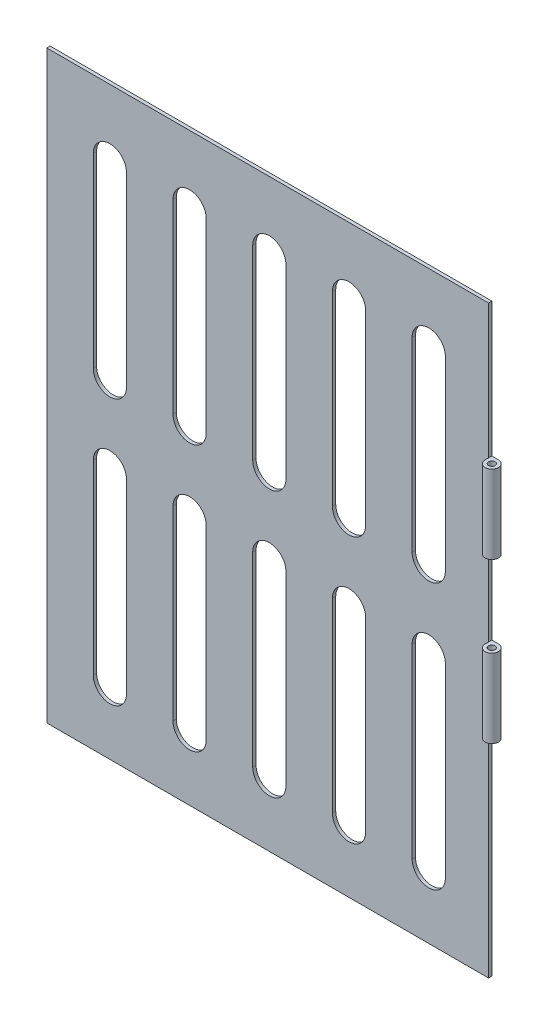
ISO-10303-21;
HEADER;
FILE_DESCRIPTION(('STEP AP214'),'2;1');
FILE_NAME('part.step','',(''),(''),'','','');
FILE_SCHEMA(('AUTOMOTIVE_DESIGN { 1 0 10303 214 1 1 1 1 }'));
ENDSEC;
DATA;
#1=APPLICATION_CONTEXT('core data for automotive mechanical design processes');
#2=APPLICATION_PROTOCOL_DEFINITION('international standard','automotive_design',2000,#1);
#3=PRODUCT_CONTEXT('',#1,'mechanical');
#4=PRODUCT('Part','Part','',(#3));
#5=PRODUCT_RELATED_PRODUCT_CATEGORY('part','',(#4));
#6=PRODUCT_DEFINITION_FORMATION('','',#4);
#7=PRODUCT_DEFINITION_CONTEXT('part definition',#1,'design');
#8=PRODUCT_DEFINITION('design','',#6,#7);
#9=PRODUCT_DEFINITION_SHAPE('','',#8);
#10=(LENGTH_UNIT() NAMED_UNIT(*) SI_UNIT(.MILLI.,.METRE.));
#11=(NAMED_UNIT(*) PLANE_ANGLE_UNIT() SI_UNIT($,.RADIAN.));
#12=(NAMED_UNIT(*) SI_UNIT($,.STERADIAN.) SOLID_ANGLE_UNIT());
#13=UNCERTAINTY_MEASURE_WITH_UNIT(LENGTH_MEASURE(1.E-05),#10,'distance_accuracy_value','');
#14=(GEOMETRIC_REPRESENTATION_CONTEXT(3) GLOBAL_UNCERTAINTY_ASSIGNED_CONTEXT((#13)) GLOBAL_UNIT_ASSIGNED_CONTEXT((#10,
#11,#12)) REPRESENTATION_CONTEXT('',''));
#15=CARTESIAN_POINT('',(0.,0.,0.));
#16=DIRECTION('',(0.,0.,1.));
#17=DIRECTION('',(1.,0.,0.));
#18=AXIS2_PLACEMENT_3D('',#15,#16,#17);
#19=CARTESIAN_POINT('',(-4419.6,-1.66533453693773E-12,-6.35000000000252));
#20=DIRECTION('',(1.,0.,0.));
#21=DIRECTION('',(0.,0.,1.));
#22=AXIS2_PLACEMENT_3D('',#19,#20,#21);
#23=PLANE('',#22);
#24=DIRECTION('',(0.,-1.,0.));
#25=VECTOR('',#24,1.);
#26=CARTESIAN_POINT('',(-4419.6,-1.77635683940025E-12,-2.22044604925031E-12));
#27=LINE('',#26,#25);
#28=CARTESIAN_POINT('',(-4419.6,711.199999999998,-3.10862446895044E-12));
#29=VERTEX_POINT('',#28);
#30=CARTESIAN_POINT('',(-4419.6,556.259999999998,-3.5527136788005E-12));
#31=VERTEX_POINT('',#30);
#32=EDGE_CURVE('E972',#29,#31,#27,.T.);
#33=ORIENTED_EDGE('',*,*,#32,.T.);
#34=DIRECTION('',(0.,0.,-1.));
#35=VECTOR('',#34,1.);
#36=CARTESIAN_POINT('',(-4419.6,556.259999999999,6.34999999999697));
#37=LINE('',#36,#35);
#38=CARTESIAN_POINT('',(-4419.6,556.259999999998,-6.3500000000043));
#39=VERTEX_POINT('',#38);
#40=EDGE_CURVE('E952',#31,#39,#37,.T.);
#41=ORIENTED_EDGE('',*,*,#40,.T.);
#42=DIRECTION('',(0.,-1.,0.));
#43=VECTOR('',#42,1.);
#44=CARTESIAN_POINT('',(-4419.6,-1.66533453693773E-12,-6.35000000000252));
#45=LINE('',#44,#43);
#46=CARTESIAN_POINT('',(-4419.6,711.199999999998,-6.35000000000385));
#47=VERTEX_POINT('',#46);
#48=EDGE_CURVE('E984',#47,#39,#45,.T.);
#49=ORIENTED_EDGE('',*,*,#48,.F.);
#50=DIRECTION('',(0.,0.,-1.));
#51=VECTOR('',#50,1.);
#52=CARTESIAN_POINT('',(-4419.6,711.199999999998,6.34999999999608));
#53=LINE('',#52,#51);
#54=EDGE_CURVE('E916',#29,#47,#53,.T.);
#55=ORIENTED_EDGE('',*,*,#54,.F.);
#56=EDGE_LOOP('',(#33,#41,#49,#55));
#57=FACE_BOUND('',#56,.T.);
#58=ADVANCED_FACE('F374',(#57),#23,.T.);
#59=CARTESIAN_POINT('',(-4419.6,406.399999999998,-2.44249065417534E-12));
#60=VERTEX_POINT('',#59);
#61=CARTESIAN_POINT('',(-4419.6,-1.77635683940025E-12,-2.22044604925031E-12));
#62=VERTEX_POINT('',#61);
#63=EDGE_CURVE('E966',#60,#62,#27,.T.);
#64=ORIENTED_EDGE('',*,*,#63,.T.);
#65=DIRECTION('',(0.,0.,1.));
#66=VECTOR('',#65,1.);
#67=CARTESIAN_POINT('',(-4419.6,-1.66533453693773E-12,-6.35000000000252));
#68=LINE('',#67,#66);
#69=CARTESIAN_POINT('',(-4419.6,-1.66533453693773E-12,-6.35000000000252));
#70=VERTEX_POINT('',#69);
#71=EDGE_CURVE('E990',#70,#62,#68,.T.);
#72=ORIENTED_EDGE('',*,*,#71,.F.);
#73=CARTESIAN_POINT('',(-4419.6,406.399999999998,-6.35000000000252));
#74=VERTEX_POINT('',#73);
#75=EDGE_CURVE('E979',#74,#70,#45,.T.);
#76=ORIENTED_EDGE('',*,*,#75,.F.);
#77=DIRECTION('',(0.,0.,-1.));
#78=VECTOR('',#77,1.);
#79=CARTESIAN_POINT('',(-4419.6,406.399999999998,6.34999999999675));
#80=LINE('',#79,#78);
#81=EDGE_CURVE('E944',#60,#74,#80,.T.);
#82=ORIENTED_EDGE('',*,*,#81,.F.);
#83=EDGE_LOOP('',(#64,#72,#76,#82));
#84=FACE_BOUND('',#83,.T.);
#85=ADVANCED_FACE('F1135',(#84),#23,.T.);
#86=DIRECTION('',(0.,0.,-1.));
#87=VECTOR('',#86,1.);
#88=CARTESIAN_POINT('',(-4419.6,861.059999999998,6.34999999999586));
#89=LINE('',#88,#87);
#90=CARTESIAN_POINT('',(-4419.6,861.059999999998,-3.99680288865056E-12));
#91=VERTEX_POINT('',#90);
#92=CARTESIAN_POINT('',(-4419.60000000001,861.059999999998,-6.35000000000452));
#93=VERTEX_POINT('',#92);
#94=EDGE_CURVE('E924',#91,#93,#89,.T.);
#95=ORIENTED_EDGE('',*,*,#94,.T.);
#96=CARTESIAN_POINT('',(-4419.6,1117.6,-6.35000000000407));
#97=VERTEX_POINT('',#96);
#98=EDGE_CURVE('E980',#97,#93,#45,.T.);
#99=ORIENTED_EDGE('',*,*,#98,.F.);
#100=DIRECTION('',(0.,0.,1.));
#101=VECTOR('',#100,1.);
#102=CARTESIAN_POINT('',(-4419.6,1117.6,-6.35000000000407));
#103=LINE('',#102,#101);
#104=CARTESIAN_POINT('',(-4419.6,1117.6,-4.44089209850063E-12));
#105=VERTEX_POINT('',#104);
#106=EDGE_CURVE('E991',#97,#105,#103,.T.);
#107=ORIENTED_EDGE('',*,*,#106,.T.);
#108=EDGE_CURVE('E967',#105,#91,#27,.T.);
#109=ORIENTED_EDGE('',*,*,#108,.T.);
#110=EDGE_LOOP('',(#95,#99,#107,#109));
#111=FACE_BOUND('',#110,.T.);
#112=ADVANCED_FACE('F376',(#111),#23,.T.);
#113=CARTESIAN_POINT('',(-4419.6,1117.6,-6.35000000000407));
#114=DIRECTION('',(0.,1.,0.));
#115=DIRECTION('',(0.,0.,1.));
#116=AXIS2_PLACEMENT_3D('',#113,#114,#115);
#117=PLANE('',#116);
#118=DIRECTION('',(1.,0.,0.));
#119=VECTOR('',#118,1.);
#120=CARTESIAN_POINT('',(-4419.6,1117.6,-4.44089209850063E-12));
#121=LINE('',#120,#119);
#122=CARTESIAN_POINT('',(-5264.15000000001,1117.6,-4.44089209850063E-12));
#123=VERTEX_POINT('',#122);
#124=EDGE_CURVE('E977',#123,#105,#121,.T.);
#125=ORIENTED_EDGE('',*,*,#124,.T.);
#126=ORIENTED_EDGE('',*,*,#106,.F.);
#127=DIRECTION('',(1.,0.,0.));
#128=VECTOR('',#127,1.);
#129=CARTESIAN_POINT('',(-4419.6,1117.6,-6.35000000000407));
#130=LINE('',#129,#128);
#131=CARTESIAN_POINT('',(-5264.15000000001,1117.6,-6.35000000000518));
#132=VERTEX_POINT('',#131);
#133=EDGE_CURVE('E988',#132,#97,#130,.T.);
#134=ORIENTED_EDGE('',*,*,#133,.F.);
#135=DIRECTION('',(0.,0.,1.));
#136=VECTOR('',#135,1.);
#137=CARTESIAN_POINT('',(-5264.15000000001,1117.6,-6.35000000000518));
#138=LINE('',#137,#136);
#139=EDGE_CURVE('E995',#132,#123,#138,.T.);
#140=ORIENTED_EDGE('',*,*,#139,.T.);
#141=EDGE_LOOP('',(#125,#126,#134,#140));
#142=FACE_BOUND('',#141,.T.);
#143=ADVANCED_FACE('F1143',(#142),#117,.T.);
#144=CARTESIAN_POINT('',(-5264.15,-1.77635683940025E-12,-6.35000000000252));
#145=DIRECTION('',(-1.,0.,0.));
#146=DIRECTION('',(0.,0.,-1.));
#147=AXIS2_PLACEMENT_3D('',#144,#145,#146);
#148=PLANE('',#147);
#149=DIRECTION('',(0.,1.,0.));
#150=VECTOR('',#149,1.);
#151=CARTESIAN_POINT('',(-5264.15,-2.22044604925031E-12,-2.88657986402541E-12));
#152=LINE('',#151,#150);
#153=CARTESIAN_POINT('',(-5264.15,-2.22044604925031E-12,-2.88657986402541E-12));
#154=VERTEX_POINT('',#153);
#155=EDGE_CURVE('E975',#154,#123,#152,.T.);
#156=ORIENTED_EDGE('',*,*,#155,.T.);
#157=ORIENTED_EDGE('',*,*,#139,.F.);
#158=DIRECTION('',(0.,1.,0.));
#159=VECTOR('',#158,1.);
#160=CARTESIAN_POINT('',(-5264.15,-1.77635683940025E-12,-6.35000000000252));
#161=LINE('',#160,#159);
#162=CARTESIAN_POINT('',(-5264.15,-1.77635683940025E-12,-6.35000000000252));
#163=VERTEX_POINT('',#162);
#164=EDGE_CURVE('E986',#163,#132,#161,.T.);
#165=ORIENTED_EDGE('',*,*,#164,.F.);
#166=DIRECTION('',(0.,0.,1.));
#167=VECTOR('',#166,1.);
#168=CARTESIAN_POINT('',(-5264.15,-1.77635683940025E-12,-6.35000000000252));
#169=LINE('',#168,#167);
#170=EDGE_CURVE('E998',#163,#154,#169,.T.);
#171=ORIENTED_EDGE('',*,*,#170,.T.);
#172=EDGE_LOOP('',(#156,#157,#165,#171));
#173=FACE_BOUND('',#172,.T.);
#174=ADVANCED_FACE('F1148',(#173),#148,.T.);
#175=CARTESIAN_POINT('',(-4419.6,-1.66533453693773E-12,-6.35000000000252));
#176=DIRECTION('',(0.,-1.,0.));
#177=DIRECTION('',(0.,0.,-1.));
#178=AXIS2_PLACEMENT_3D('',#175,#176,#177);
#179=PLANE('',#178);
#180=DIRECTION('',(-1.,0.,0.));
#181=VECTOR('',#180,1.);
#182=CARTESIAN_POINT('',(-4419.6,-1.77635683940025E-12,-2.22044604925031E-12));
#183=LINE('',#182,#181);
#184=EDGE_CURVE('E970',#62,#154,#183,.T.);
#185=ORIENTED_EDGE('',*,*,#184,.T.);
#186=ORIENTED_EDGE('',*,*,#170,.F.);
#187=DIRECTION('',(-1.,0.,0.));
#188=VECTOR('',#187,1.);
#189=CARTESIAN_POINT('',(-4419.6,-1.66533453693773E-12,-6.35000000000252));
#190=LINE('',#189,#188);
#191=EDGE_CURVE('E983',#70,#163,#190,.T.);
#192=ORIENTED_EDGE('',*,*,#191,.F.);
#193=ORIENTED_EDGE('',*,*,#71,.T.);
#194=EDGE_LOOP('',(#185,#186,#192,#193));
#195=FACE_BOUND('',#194,.T.);
#196=ADVANCED_FACE('F1193',(#195),#179,.T.);
#197=CARTESIAN_POINT('',(-4419.6,1117.6,-6.35000000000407));
#198=DIRECTION('',(0.,0.,-1.));
#199=DIRECTION('',(1.,0.,0.));
#200=AXIS2_PLACEMENT_3D('',#197,#198,#199);
#201=PLANE('',#200);
#202=CARTESIAN_POINT('',(-4533.89999999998,479.552000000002,-6.35000000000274));
#203=DIRECTION('',(0.,0.,1.));
#204=DIRECTION('',(-1.,0.,0.));
#205=AXIS2_PLACEMENT_3D('',#202,#203,#204);
#206=CIRCLE('',#205,31.7500000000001);
#207=CARTESIAN_POINT('',(-4502.14999999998,479.552000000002,-6.35000000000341));
#208=VERTEX_POINT('',#207);
#209=CARTESIAN_POINT('',(-4565.64999999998,479.552,-6.35000000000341));
#210=VERTEX_POINT('',#209);
#211=EDGE_CURVE('E721',#208,#210,#206,.T.);
#212=ORIENTED_EDGE('',*,*,#211,.T.);
#213=DIRECTION('',(0.,-1.,0.));
#214=VECTOR('',#213,1.);
#215=CARTESIAN_POINT('',(-4565.64999999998,479.552,-6.35000000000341));
#216=LINE('',#215,#214);
#217=CARTESIAN_POINT('',(-4565.64999999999,123.952000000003,-6.35000000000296));
#218=VERTEX_POINT('',#217);
#219=EDGE_CURVE('E704',#210,#218,#216,.T.);
#220=ORIENTED_EDGE('',*,*,#219,.T.);
#221=CARTESIAN_POINT('',(-4533.89999999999,123.952000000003,-6.35000000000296));
#222=DIRECTION('',(0.,0.,1.));
#223=DIRECTION('',(-1.,0.,0.));
#224=AXIS2_PLACEMENT_3D('',#221,#222,#223);
#225=CIRCLE('',#224,31.7500000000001);
#226=CARTESIAN_POINT('',(-4502.14999999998,123.952000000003,-6.35000000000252));
#227=VERTEX_POINT('',#226);
#228=EDGE_CURVE('E712',#218,#227,#225,.T.);
#229=ORIENTED_EDGE('',*,*,#228,.T.);
#230=DIRECTION('',(0.,1.,0.));
#231=VECTOR('',#230,1.);
#232=CARTESIAN_POINT('',(-4502.14999999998,479.552000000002,-6.35000000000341));
#233=LINE('',#232,#231);
#234=EDGE_CURVE('E717',#227,#208,#233,.T.);
#235=ORIENTED_EDGE('',*,*,#234,.T.);
#236=EDGE_LOOP('',(#212,#220,#229,#235));
#237=FACE_BOUND('',#236,.T.);
#238=CARTESIAN_POINT('',(-4686.3,479.552000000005,-6.35000000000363));
#239=DIRECTION('',(0.,0.,1.));
#240=DIRECTION('',(-1.,0.,0.));
#241=AXIS2_PLACEMENT_3D('',#238,#239,#240);
#242=CIRCLE('',#241,31.75);
#243=CARTESIAN_POINT('',(-4654.55,479.552000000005,-6.3500000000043));
#244=VERTEX_POINT('',#243);
#245=CARTESIAN_POINT('',(-4718.05,479.552000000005,-6.35000000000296));
#246=VERTEX_POINT('',#245);
#247=EDGE_CURVE('E728',#244,#246,#242,.T.);
#248=ORIENTED_EDGE('',*,*,#247,.T.);
#249=DIRECTION('',(0.,-1.,0.));
#250=VECTOR('',#249,1.);
#251=CARTESIAN_POINT('',(-4718.05,479.552000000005,-6.35000000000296));
#252=LINE('',#251,#250);
#253=CARTESIAN_POINT('',(-4718.05,123.952000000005,-6.35000000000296));
#254=VERTEX_POINT('',#253);
#255=EDGE_CURVE('E733',#246,#254,#252,.T.);
#256=ORIENTED_EDGE('',*,*,#255,.T.);
#257=CARTESIAN_POINT('',(-4686.3,123.952000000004,-6.35000000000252));
#258=DIRECTION('',(0.,0.,1.));
#259=DIRECTION('',(-1.,0.,0.));
#260=AXIS2_PLACEMENT_3D('',#257,#258,#259);
#261=CIRCLE('',#260,31.7499999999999);
#262=CARTESIAN_POINT('',(-4654.55,123.952000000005,-6.35000000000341));
#263=VERTEX_POINT('',#262);
#264=EDGE_CURVE('E736',#254,#263,#261,.T.);
#265=ORIENTED_EDGE('',*,*,#264,.T.);
#266=DIRECTION('',(0.,1.,0.));
#267=VECTOR('',#266,1.);
#268=CARTESIAN_POINT('',(-4654.55,479.552000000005,-6.3500000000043));
#269=LINE('',#268,#267);
#270=EDGE_CURVE('E739',#263,#244,#269,.T.);
#271=ORIENTED_EDGE('',*,*,#270,.T.);
#272=EDGE_LOOP('',(#248,#256,#265,#271));
#273=FACE_BOUND('',#272,.T.);
#274=CARTESIAN_POINT('',(-4838.7,479.552000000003,-6.35000000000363));
#275=DIRECTION('',(0.,0.,1.));
#276=DIRECTION('',(-1.,0.,0.));
#277=AXIS2_PLACEMENT_3D('',#274,#275,#276);
#278=CIRCLE('',#277,31.75);
#279=CARTESIAN_POINT('',(-4806.95,479.552000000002,-6.35000000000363));
#280=VERTEX_POINT('',#279);
#281=CARTESIAN_POINT('',(-4870.44999999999,479.552000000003,-6.35000000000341));
#282=VERTEX_POINT('',#281);
#283=EDGE_CURVE('E745',#280,#282,#278,.T.);
#284=ORIENTED_EDGE('',*,*,#283,.T.);
#285=DIRECTION('',(0.,-1.,0.));
#286=VECTOR('',#285,1.);
#287=CARTESIAN_POINT('',(-4870.44999999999,479.552000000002,-6.35000000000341));
#288=LINE('',#287,#286);
#289=CARTESIAN_POINT('',(-4870.45,123.952000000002,-6.35000000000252));
#290=VERTEX_POINT('',#289);
#291=EDGE_CURVE('E753',#282,#290,#288,.T.);
#292=ORIENTED_EDGE('',*,*,#291,.T.);
#293=CARTESIAN_POINT('',(-4838.7,123.952000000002,-6.35000000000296));
#294=DIRECTION('',(0.,0.,1.));
#295=DIRECTION('',(-1.,0.,0.));
#296=AXIS2_PLACEMENT_3D('',#293,#294,#295);
#297=CIRCLE('',#296,31.7499999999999);
#298=CARTESIAN_POINT('',(-4806.95,123.952000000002,-6.35000000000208));
#299=VERTEX_POINT('',#298);
#300=EDGE_CURVE('E756',#290,#299,#297,.T.);
#301=ORIENTED_EDGE('',*,*,#300,.T.);
#302=DIRECTION('',(0.,1.,0.));
#303=VECTOR('',#302,1.);
#304=CARTESIAN_POINT('',(-4806.95,479.552000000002,-6.35000000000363));
#305=LINE('',#304,#303);
#306=EDGE_CURVE('E759',#299,#280,#305,.T.);
#307=ORIENTED_EDGE('',*,*,#306,.T.);
#308=EDGE_LOOP('',(#284,#292,#301,#307));
#309=FACE_BOUND('',#308,.T.);
#310=CARTESIAN_POINT('',(-4991.1,479.552000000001,-6.35000000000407));
#311=DIRECTION('',(0.,0.,1.));
#312=DIRECTION('',(-1.,0.,0.));
#313=AXIS2_PLACEMENT_3D('',#310,#311,#312);
#314=CIRCLE('',#313,31.75);
#315=CARTESIAN_POINT('',(-4959.34999999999,479.552,-6.35000000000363));
#316=VERTEX_POINT('',#315);
#317=CARTESIAN_POINT('',(-5022.85,479.552,-6.3500000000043));
#318=VERTEX_POINT('',#317);
#319=EDGE_CURVE('E765',#316,#318,#314,.T.);
#320=ORIENTED_EDGE('',*,*,#319,.T.);
#321=DIRECTION('',(0.,-1.,0.));
#322=VECTOR('',#321,1.);
#323=CARTESIAN_POINT('',(-5022.85,479.552,-6.35000000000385));
#324=LINE('',#323,#322);
#325=CARTESIAN_POINT('',(-5022.85,123.952,-6.35000000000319));
#326=VERTEX_POINT('',#325);
#327=EDGE_CURVE('E773',#318,#326,#324,.T.);
#328=ORIENTED_EDGE('',*,*,#327,.T.);
#329=CARTESIAN_POINT('',(-4991.1,123.952,-6.35000000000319));
#330=DIRECTION('',(0.,0.,1.));
#331=DIRECTION('',(-1.,0.,0.));
#332=AXIS2_PLACEMENT_3D('',#329,#330,#331);
#333=CIRCLE('',#332,31.7499999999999);
#334=CARTESIAN_POINT('',(-4959.34999999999,123.952,-6.35000000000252));
#335=VERTEX_POINT('',#334);
#336=EDGE_CURVE('E776',#326,#335,#333,.T.);
#337=ORIENTED_EDGE('',*,*,#336,.T.);
#338=DIRECTION('',(0.,1.,0.));
#339=VECTOR('',#338,1.);
#340=CARTESIAN_POINT('',(-4959.34999999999,479.552,-6.35000000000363));
#341=LINE('',#340,#339);
#342=EDGE_CURVE('E779',#335,#316,#341,.T.);
#343=ORIENTED_EDGE('',*,*,#342,.T.);
#344=EDGE_LOOP('',(#320,#328,#337,#343));
#345=FACE_BOUND('',#344,.T.);
#346=CARTESIAN_POINT('',(-5143.49999999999,479.551999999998,-6.35000000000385));
#347=DIRECTION('',(0.,0.,1.));
#348=DIRECTION('',(-1.,0.,0.));
#349=AXIS2_PLACEMENT_3D('',#346,#347,#348);
#350=CIRCLE('',#349,31.75);
#351=CARTESIAN_POINT('',(-5111.75,479.551999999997,-6.35000000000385));
#352=VERTEX_POINT('',#351);
#353=CARTESIAN_POINT('',(-5175.24999999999,479.551999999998,-6.3500000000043));
#354=VERTEX_POINT('',#353);
#355=EDGE_CURVE('E785',#352,#354,#350,.T.);
#356=ORIENTED_EDGE('',*,*,#355,.T.);
#357=DIRECTION('',(0.,-1.,0.));
#358=VECTOR('',#357,1.);
#359=CARTESIAN_POINT('',(-5175.24999999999,479.551999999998,-6.3500000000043));
#360=LINE('',#359,#358);
#361=CARTESIAN_POINT('',(-5175.25,123.951999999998,-6.35000000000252));
#362=VERTEX_POINT('',#361);
#363=EDGE_CURVE('E793',#354,#362,#360,.T.);
#364=ORIENTED_EDGE('',*,*,#363,.T.);
#365=CARTESIAN_POINT('',(-5143.49999999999,123.951999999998,-6.35000000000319));
#366=DIRECTION('',(0.,0.,1.));
#367=DIRECTION('',(-1.,0.,0.));
#368=AXIS2_PLACEMENT_3D('',#365,#366,#367);
#369=CIRCLE('',#368,31.7499999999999);
#370=CARTESIAN_POINT('',(-5111.75,123.951999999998,-6.35000000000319));
#371=VERTEX_POINT('',#370);
#372=EDGE_CURVE('E796',#362,#371,#369,.T.);
#373=ORIENTED_EDGE('',*,*,#372,.T.);
#374=DIRECTION('',(0.,1.,0.));
#375=VECTOR('',#374,1.);
#376=CARTESIAN_POINT('',(-5111.75,479.551999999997,-6.35000000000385));
#377=LINE('',#376,#375);
#378=EDGE_CURVE('E799',#371,#352,#377,.T.);
#379=ORIENTED_EDGE('',*,*,#378,.T.);
#380=EDGE_LOOP('',(#356,#364,#373,#379));
#381=FACE_BOUND('',#380,.T.);
#382=CARTESIAN_POINT('',(-4533.89999999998,987.552000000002,-6.35000000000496));
#383=DIRECTION('',(0.,0.,1.));
#384=DIRECTION('',(-1.,0.,0.));
#385=AXIS2_PLACEMENT_3D('',#382,#383,#384);
#386=CIRCLE('',#385,31.7500000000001);
#387=CARTESIAN_POINT('',(-4502.14999999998,987.552000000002,-6.35000000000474));
#388=VERTEX_POINT('',#387);
#389=CARTESIAN_POINT('',(-4565.64999999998,987.551999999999,-6.3500000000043));
#390=VERTEX_POINT('',#389);
#391=EDGE_CURVE('E805',#388,#390,#386,.T.);
#392=ORIENTED_EDGE('',*,*,#391,.T.);
#393=DIRECTION('',(0.,-1.,0.));
#394=VECTOR('',#393,1.);
#395=CARTESIAN_POINT('',(-4565.64999999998,987.551999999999,-6.3500000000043));
#396=LINE('',#395,#394);
#397=CARTESIAN_POINT('',(-4565.64999999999,631.952000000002,-6.35000000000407));
#398=VERTEX_POINT('',#397);
#399=EDGE_CURVE('E813',#390,#398,#396,.T.);
#400=ORIENTED_EDGE('',*,*,#399,.T.);
#401=CARTESIAN_POINT('',(-4533.89999999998,631.952000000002,-6.35000000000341));
#402=DIRECTION('',(0.,0.,1.));
#403=DIRECTION('',(-1.,0.,0.));
#404=AXIS2_PLACEMENT_3D('',#401,#402,#403);
#405=CIRCLE('',#404,31.7500000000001);
#406=CARTESIAN_POINT('',(-4502.14999999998,631.952000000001,-6.35000000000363));
#407=VERTEX_POINT('',#406);
#408=EDGE_CURVE('E816',#398,#407,#405,.T.);
#409=ORIENTED_EDGE('',*,*,#408,.T.);
#410=DIRECTION('',(0.,1.,0.));
#411=VECTOR('',#410,1.);
#412=CARTESIAN_POINT('',(-4502.14999999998,987.552000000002,-6.35000000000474));
#413=LINE('',#412,#411);
#414=EDGE_CURVE('E819',#407,#388,#413,.T.);
#415=ORIENTED_EDGE('',*,*,#414,.T.);
#416=EDGE_LOOP('',(#392,#400,#409,#415));
#417=FACE_BOUND('',#416,.T.);
#418=CARTESIAN_POINT('',(-4686.29999999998,987.552000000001,-6.3500000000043));
#419=DIRECTION('',(0.,0.,1.));
#420=DIRECTION('',(-1.,0.,0.));
#421=AXIS2_PLACEMENT_3D('',#418,#419,#420);
#422=CIRCLE('',#421,31.75);
#423=CARTESIAN_POINT('',(-4654.54999999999,987.552000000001,-6.35000000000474));
#424=VERTEX_POINT('',#423);
#425=CARTESIAN_POINT('',(-4718.04999999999,987.551999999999,-6.35000000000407));
#426=VERTEX_POINT('',#425);
#427=EDGE_CURVE('E825',#424,#426,#422,.T.);
#428=ORIENTED_EDGE('',*,*,#427,.T.);
#429=DIRECTION('',(0.,-1.,0.));
#430=VECTOR('',#429,1.);
#431=CARTESIAN_POINT('',(-4718.04999999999,987.552,-6.35000000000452));
#432=LINE('',#431,#430);
#433=CARTESIAN_POINT('',(-4718.04999999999,631.952000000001,-6.35000000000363));
#434=VERTEX_POINT('',#433);
#435=EDGE_CURVE('E833',#426,#434,#432,.T.);
#436=ORIENTED_EDGE('',*,*,#435,.T.);
#437=CARTESIAN_POINT('',(-4686.29999999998,631.952000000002,-6.3500000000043));
#438=DIRECTION('',(0.,0.,1.));
#439=DIRECTION('',(-1.,0.,0.));
#440=AXIS2_PLACEMENT_3D('',#437,#438,#439);
#441=CIRCLE('',#440,31.75);
#442=CARTESIAN_POINT('',(-4654.54999999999,631.952000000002,-6.35000000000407));
#443=VERTEX_POINT('',#442);
#444=EDGE_CURVE('E836',#434,#443,#441,.T.);
#445=ORIENTED_EDGE('',*,*,#444,.T.);
#446=DIRECTION('',(0.,1.,0.));
#447=VECTOR('',#446,1.);
#448=CARTESIAN_POINT('',(-4654.54999999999,987.552000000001,-6.35000000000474));
#449=LINE('',#448,#447);
#450=EDGE_CURVE('E839',#443,#424,#449,.T.);
#451=ORIENTED_EDGE('',*,*,#450,.T.);
#452=EDGE_LOOP('',(#428,#436,#445,#451));
#453=FACE_BOUND('',#452,.T.);
#454=CARTESIAN_POINT('',(-4838.7,987.552000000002,-6.35000000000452));
#455=DIRECTION('',(0.,0.,1.));
#456=DIRECTION('',(-1.,0.,0.));
#457=AXIS2_PLACEMENT_3D('',#454,#455,#456);
#458=CIRCLE('',#457,31.75);
#459=CARTESIAN_POINT('',(-4806.95,987.552000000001,-6.35000000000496));
#460=VERTEX_POINT('',#459);
#461=CARTESIAN_POINT('',(-4870.45,987.552000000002,-6.3500000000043));
#462=VERTEX_POINT('',#461);
#463=EDGE_CURVE('E845',#460,#462,#458,.T.);
#464=ORIENTED_EDGE('',*,*,#463,.T.);
#465=DIRECTION('',(0.,-1.,0.));
#466=VECTOR('',#465,1.);
#467=CARTESIAN_POINT('',(-4870.45,987.552000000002,-6.3500000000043));
#468=LINE('',#467,#466);
#469=CARTESIAN_POINT('',(-4870.45,631.952000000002,-6.3500000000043));
#470=VERTEX_POINT('',#469);
#471=EDGE_CURVE('E853',#462,#470,#468,.T.);
#472=ORIENTED_EDGE('',*,*,#471,.T.);
#473=CARTESIAN_POINT('',(-4838.70000000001,631.952000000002,-6.35000000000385));
#474=DIRECTION('',(0.,0.,1.));
#475=DIRECTION('',(-1.,0.,0.));
#476=AXIS2_PLACEMENT_3D('',#473,#474,#475);
#477=CIRCLE('',#476,31.7499999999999);
#478=CARTESIAN_POINT('',(-4806.95,631.952000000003,-6.35000000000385));
#479=VERTEX_POINT('',#478);
#480=EDGE_CURVE('E856',#470,#479,#477,.T.);
#481=ORIENTED_EDGE('',*,*,#480,.T.);
#482=DIRECTION('',(0.,1.,0.));
#483=VECTOR('',#482,1.);
#484=CARTESIAN_POINT('',(-4806.95,987.552000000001,-6.35000000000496));
#485=LINE('',#484,#483);
#486=EDGE_CURVE('E859',#479,#460,#485,.T.);
#487=ORIENTED_EDGE('',*,*,#486,.T.);
#488=EDGE_LOOP('',(#464,#472,#481,#487));
#489=FACE_BOUND('',#488,.T.);
#490=CARTESIAN_POINT('',(-4991.10000000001,987.552000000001,-6.35000000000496));
#491=DIRECTION('',(0.,0.,1.));
#492=DIRECTION('',(-1.,0.,0.));
#493=AXIS2_PLACEMENT_3D('',#490,#491,#492);
#494=CIRCLE('',#493,31.75);
#495=CARTESIAN_POINT('',(-4959.35,987.552000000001,-6.35000000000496));
#496=VERTEX_POINT('',#495);
#497=CARTESIAN_POINT('',(-5022.85000000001,987.552,-6.3500000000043));
#498=VERTEX_POINT('',#497);
#499=EDGE_CURVE('E865',#496,#498,#494,.T.);
#500=ORIENTED_EDGE('',*,*,#499,.T.);
#501=DIRECTION('',(0.,-1.,0.));
#502=VECTOR('',#501,1.);
#503=CARTESIAN_POINT('',(-5022.85000000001,987.552,-6.35000000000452));
#504=LINE('',#503,#502);
#505=CARTESIAN_POINT('',(-5022.85000000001,631.952,-6.3500000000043));
#506=VERTEX_POINT('',#505);
#507=EDGE_CURVE('E873',#498,#506,#504,.T.);
#508=ORIENTED_EDGE('',*,*,#507,.T.);
#509=CARTESIAN_POINT('',(-4991.10000000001,631.952,-6.35000000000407));
#510=DIRECTION('',(0.,0.,1.));
#511=DIRECTION('',(-1.,0.,0.));
#512=AXIS2_PLACEMENT_3D('',#509,#510,#511);
#513=CIRCLE('',#512,31.7499999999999);
#514=CARTESIAN_POINT('',(-4959.35,631.952,-6.35000000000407));
#515=VERTEX_POINT('',#514);
#516=EDGE_CURVE('E876',#506,#515,#513,.T.);
#517=ORIENTED_EDGE('',*,*,#516,.T.);
#518=DIRECTION('',(0.,1.,0.));
#519=VECTOR('',#518,1.);
#520=CARTESIAN_POINT('',(-4959.35,987.552000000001,-6.35000000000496));
#521=LINE('',#520,#519);
#522=EDGE_CURVE('E879',#515,#496,#521,.T.);
#523=ORIENTED_EDGE('',*,*,#522,.T.);
#524=EDGE_LOOP('',(#500,#508,#517,#523));
#525=FACE_BOUND('',#524,.T.);
#526=CARTESIAN_POINT('',(-5143.5,987.551999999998,-6.3500000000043));
#527=DIRECTION('',(0.,0.,1.));
#528=DIRECTION('',(-1.,0.,0.));
#529=AXIS2_PLACEMENT_3D('',#526,#527,#528);
#530=CIRCLE('',#529,31.75);
#531=CARTESIAN_POINT('',(-5111.75000000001,987.551999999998,-6.35000000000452));
#532=VERTEX_POINT('',#531);
#533=CARTESIAN_POINT('',(-5175.25000000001,987.551999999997,-6.35000000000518));
#534=VERTEX_POINT('',#533);
#535=EDGE_CURVE('E885',#532,#534,#530,.T.);
#536=ORIENTED_EDGE('',*,*,#535,.T.);
#537=DIRECTION('',(0.,-1.,0.));
#538=VECTOR('',#537,1.);
#539=CARTESIAN_POINT('',(-5175.25000000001,987.551999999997,-6.35000000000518));
#540=LINE('',#539,#538);
#541=CARTESIAN_POINT('',(-5175.25,631.951999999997,-6.35000000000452));
#542=VERTEX_POINT('',#541);
#543=EDGE_CURVE('E893',#534,#542,#540,.T.);
#544=ORIENTED_EDGE('',*,*,#543,.T.);
#545=CARTESIAN_POINT('',(-5143.5,631.951999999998,-6.3500000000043));
#546=DIRECTION('',(0.,0.,1.));
#547=DIRECTION('',(-1.,0.,0.));
#548=AXIS2_PLACEMENT_3D('',#545,#546,#547);
#549=CIRCLE('',#548,31.7499999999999);
#550=CARTESIAN_POINT('',(-5111.75000000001,631.951999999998,-6.35000000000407));
#551=VERTEX_POINT('',#550);
#552=EDGE_CURVE('E896',#542,#551,#549,.T.);
#553=ORIENTED_EDGE('',*,*,#552,.T.);
#554=DIRECTION('',(0.,1.,0.));
#555=VECTOR('',#554,1.);
#556=CARTESIAN_POINT('',(-5111.75000000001,987.551999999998,-6.35000000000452));
#557=LINE('',#556,#555);
#558=EDGE_CURVE('E899',#551,#532,#557,.T.);
#559=ORIENTED_EDGE('',*,*,#558,.T.);
#560=EDGE_LOOP('',(#536,#544,#553,#559));
#561=FACE_BOUND('',#560,.T.);
#562=ORIENTED_EDGE('',*,*,#98,.T.);
#563=DIRECTION('',(1.,0.,0.));
#564=VECTOR('',#563,1.);
#565=CARTESIAN_POINT('',(-4419.60000000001,861.059999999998,-6.35000000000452));
#566=LINE('',#565,#564);
#567=CARTESIAN_POINT('',(-4406.9,861.059999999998,-6.35000000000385));
#568=VERTEX_POINT('',#567);
#569=EDGE_CURVE('E927',#93,#568,#566,.T.);
#570=ORIENTED_EDGE('',*,*,#569,.T.);
#571=DIRECTION('',(0.,-1.,0.));
#572=VECTOR('',#571,1.);
#573=CARTESIAN_POINT('',(-4406.9,861.059999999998,-6.35000000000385));
#574=LINE('',#573,#572);
#575=CARTESIAN_POINT('',(-4406.9,711.199999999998,-6.35000000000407));
#576=VERTEX_POINT('',#575);
#577=EDGE_CURVE('E935',#568,#576,#574,.T.);
#578=ORIENTED_EDGE('',*,*,#577,.T.);
#579=DIRECTION('',(1.,0.,0.));
#580=VECTOR('',#579,1.);
#581=CARTESIAN_POINT('',(-4419.6,711.199999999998,-6.35000000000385));
#582=LINE('',#581,#580);
#583=EDGE_CURVE('E919',#47,#576,#582,.T.);
#584=ORIENTED_EDGE('',*,*,#583,.F.);
#585=ORIENTED_EDGE('',*,*,#48,.T.);
#586=DIRECTION('',(1.,0.,0.));
#587=VECTOR('',#586,1.);
#588=CARTESIAN_POINT('',(-4419.6,556.259999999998,-6.3500000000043));
#589=LINE('',#588,#587);
#590=CARTESIAN_POINT('',(-4406.9,556.259999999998,-6.35000000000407));
#591=VERTEX_POINT('',#590);
#592=EDGE_CURVE('E955',#39,#591,#589,.T.);
#593=ORIENTED_EDGE('',*,*,#592,.T.);
#594=DIRECTION('',(0.,-1.,0.));
#595=VECTOR('',#594,1.);
#596=CARTESIAN_POINT('',(-4406.9,556.259999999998,-6.35000000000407));
#597=LINE('',#596,#595);
#598=CARTESIAN_POINT('',(-4406.9,406.399999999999,-6.35000000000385));
#599=VERTEX_POINT('',#598);
#600=EDGE_CURVE('E963',#591,#599,#597,.T.);
#601=ORIENTED_EDGE('',*,*,#600,.T.);
#602=DIRECTION('',(1.,0.,0.));
#603=VECTOR('',#602,1.);
#604=CARTESIAN_POINT('',(-4419.6,406.399999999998,-6.35000000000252));
#605=LINE('',#604,#603);
#606=EDGE_CURVE('E947',#74,#599,#605,.T.);
#607=ORIENTED_EDGE('',*,*,#606,.F.);
#608=ORIENTED_EDGE('',*,*,#75,.T.);
#609=ORIENTED_EDGE('',*,*,#191,.T.);
#610=ORIENTED_EDGE('',*,*,#164,.T.);
#611=ORIENTED_EDGE('',*,*,#133,.T.);
#612=EDGE_LOOP('',(#562,#570,#578,#584,#585,#593,#601,#607,#608,#609,#610,#611));
#613=FACE_BOUND('',#612,.T.);
#614=ADVANCED_FACE('F719',(#237,#273,#309,#345,#381,#417,#453,#489,#525,#561,#613),#201,.T.);
#615=CARTESIAN_POINT('',(-4419.6,1117.6,-4.44089209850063E-12));
#616=DIRECTION('',(0.,0.,-1.));
#617=DIRECTION('',(1.,0.,0.));
#618=AXIS2_PLACEMENT_3D('',#615,#616,#617);
#619=PLANE('',#618);
#620=DIRECTION('',(0.,1.,0.));
#621=VECTOR('',#620,1.);
#622=CARTESIAN_POINT('',(-4502.14999999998,1117.6,-5.32907051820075E-12));
#623=LINE('',#622,#621);
#624=CARTESIAN_POINT('',(-4502.14999999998,123.952000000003,-2.66453525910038E-12));
#625=VERTEX_POINT('',#624);
#626=CARTESIAN_POINT('',(-4502.14999999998,479.552000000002,-2.88657986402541E-12));
#627=VERTEX_POINT('',#626);
#628=EDGE_CURVE('E382',#625,#627,#623,.T.);
#629=ORIENTED_EDGE('',*,*,#628,.F.);
#630=CARTESIAN_POINT('',(-4533.89999999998,123.952000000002,-2.88657986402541E-12));
#631=DIRECTION('',(0.,0.,1.));
#632=DIRECTION('',(1.,0.,0.));
#633=AXIS2_PLACEMENT_3D('',#630,#631,#632);
#634=CIRCLE('',#633,31.7500000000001);
#635=CARTESIAN_POINT('',(-4565.64999999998,123.952000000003,-3.10862446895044E-12));
#636=VERTEX_POINT('',#635);
#637=EDGE_CURVE('E1111',#636,#625,#634,.T.);
#638=ORIENTED_EDGE('',*,*,#637,.F.);
#639=DIRECTION('',(0.,-1.,0.));
#640=VECTOR('',#639,1.);
#641=CARTESIAN_POINT('',(-4565.64999999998,1117.6,-4.88498130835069E-12));
#642=LINE('',#641,#640);
#643=CARTESIAN_POINT('',(-4565.64999999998,479.552000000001,-3.33066907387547E-12));
#644=VERTEX_POINT('',#643);
#645=EDGE_CURVE('E707',#644,#636,#642,.T.);
#646=ORIENTED_EDGE('',*,*,#645,.F.);
#647=CARTESIAN_POINT('',(-4533.89999999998,479.552000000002,-3.33066907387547E-12));
#648=DIRECTION('',(0.,0.,1.));
#649=DIRECTION('',(1.,0.,0.));
#650=AXIS2_PLACEMENT_3D('',#647,#648,#649);
#651=CIRCLE('',#650,31.7500000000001);
#652=EDGE_CURVE('E11',#627,#644,#651,.T.);
#653=ORIENTED_EDGE('',*,*,#652,.F.);
#654=EDGE_LOOP('',(#629,#638,#646,#653));
#655=FACE_BOUND('',#654,.T.);
#656=DIRECTION('',(0.,1.,0.));
#657=VECTOR('',#656,1.);
#658=CARTESIAN_POINT('',(-4654.54999999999,1117.6,-4.88498130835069E-12));
#659=LINE('',#658,#657);
#660=CARTESIAN_POINT('',(-4654.55,123.952000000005,-3.33066907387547E-12));
#661=VERTEX_POINT('',#660);
#662=CARTESIAN_POINT('',(-4654.54999999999,479.552000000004,-3.77475828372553E-12));
#663=VERTEX_POINT('',#662);
#664=EDGE_CURVE('E1104',#661,#663,#659,.T.);
#665=ORIENTED_EDGE('',*,*,#664,.F.);
#666=CARTESIAN_POINT('',(-4686.3,123.952000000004,-3.10862446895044E-12));
#667=DIRECTION('',(0.,0.,1.));
#668=DIRECTION('',(1.,0.,0.));
#669=AXIS2_PLACEMENT_3D('',#666,#667,#668);
#670=CIRCLE('',#669,31.7499999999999);
#671=CARTESIAN_POINT('',(-4718.05,123.952000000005,-2.22044604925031E-12));
#672=VERTEX_POINT('',#671);
#673=EDGE_CURVE('E1101',#672,#661,#670,.T.);
#674=ORIENTED_EDGE('',*,*,#673,.F.);
#675=DIRECTION('',(0.,-1.,0.));
#676=VECTOR('',#675,1.);
#677=CARTESIAN_POINT('',(-4718.04999999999,1117.6,-4.66293670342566E-12));
#678=LINE('',#677,#676);
#679=CARTESIAN_POINT('',(-4718.04999999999,479.552000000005,-3.33066907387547E-12));
#680=VERTEX_POINT('',#679);
#681=EDGE_CURVE('E1098',#680,#672,#678,.T.);
#682=ORIENTED_EDGE('',*,*,#681,.F.);
#683=CARTESIAN_POINT('',(-4686.29999999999,479.552000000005,-3.33066907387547E-12));
#684=DIRECTION('',(0.,0.,1.));
#685=DIRECTION('',(1.,0.,0.));
#686=AXIS2_PLACEMENT_3D('',#683,#684,#685);
#687=CIRCLE('',#686,31.75);
#688=EDGE_CURVE('E1107',#663,#680,#687,.T.);
#689=ORIENTED_EDGE('',*,*,#688,.F.);
#690=EDGE_LOOP('',(#665,#674,#682,#689));
#691=FACE_BOUND('',#690,.T.);
#692=DIRECTION('',(0.,1.,0.));
#693=VECTOR('',#692,1.);
#694=CARTESIAN_POINT('',(-4806.95,1117.6,-5.10702591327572E-12));
#695=LINE('',#694,#693);
#696=CARTESIAN_POINT('',(-4806.95,123.952000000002,-2.66453525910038E-12));
#697=VERTEX_POINT('',#696);
#698=CARTESIAN_POINT('',(-4806.95,479.552000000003,-3.77475828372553E-12));
#699=VERTEX_POINT('',#698);
#700=EDGE_CURVE('E1092',#697,#699,#695,.T.);
#701=ORIENTED_EDGE('',*,*,#700,.F.);
#702=CARTESIAN_POINT('',(-4838.7,123.952000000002,-2.22044604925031E-12));
#703=DIRECTION('',(0.,0.,1.));
#704=DIRECTION('',(1.,0.,0.));
#705=AXIS2_PLACEMENT_3D('',#702,#703,#704);
#706=CIRCLE('',#705,31.7499999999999);
#707=CARTESIAN_POINT('',(-4870.44999999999,123.952000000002,-3.10862446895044E-12));
#708=VERTEX_POINT('',#707);
#709=EDGE_CURVE('E1089',#708,#697,#706,.T.);
#710=ORIENTED_EDGE('',*,*,#709,.F.);
#711=DIRECTION('',(0.,-1.,0.));
#712=VECTOR('',#711,1.);
#713=CARTESIAN_POINT('',(-4870.44999999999,1117.6,-4.66293670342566E-12));
#714=LINE('',#713,#712);
#715=CARTESIAN_POINT('',(-4870.44999999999,479.552000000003,-3.33066907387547E-12));
#716=VERTEX_POINT('',#715);
#717=EDGE_CURVE('E1086',#716,#708,#714,.T.);
#718=ORIENTED_EDGE('',*,*,#717,.F.);
#719=CARTESIAN_POINT('',(-4838.7,479.552000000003,-3.33066907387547E-12));
#720=DIRECTION('',(0.,0.,1.));
#721=DIRECTION('',(1.,0.,0.));
#722=AXIS2_PLACEMENT_3D('',#719,#720,#721);
#723=CIRCLE('',#722,31.75);
#724=EDGE_CURVE('E1095',#699,#716,#723,.T.);
#725=ORIENTED_EDGE('',*,*,#724,.F.);
#726=EDGE_LOOP('',(#701,#710,#718,#725));
#727=FACE_BOUND('',#726,.T.);
#728=DIRECTION('',(0.,1.,0.));
#729=VECTOR('',#728,1.);
#730=CARTESIAN_POINT('',(-4959.34999999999,1117.6,-4.66293670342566E-12));
#731=LINE('',#730,#729);
#732=CARTESIAN_POINT('',(-4959.34999999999,123.952,-3.10862446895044E-12));
#733=VERTEX_POINT('',#732);
#734=CARTESIAN_POINT('',(-4959.34999999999,479.552,-3.33066907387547E-12));
#735=VERTEX_POINT('',#734);
#736=EDGE_CURVE('E1080',#733,#735,#731,.T.);
#737=ORIENTED_EDGE('',*,*,#736,.F.);
#738=CARTESIAN_POINT('',(-4991.1,123.952,-2.66453525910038E-12));
#739=DIRECTION('',(0.,0.,1.));
#740=DIRECTION('',(1.,0.,0.));
#741=AXIS2_PLACEMENT_3D('',#738,#739,#740);
#742=CIRCLE('',#741,31.7499999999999);
#743=CARTESIAN_POINT('',(-5022.85,123.952000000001,-3.10862446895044E-12));
#744=VERTEX_POINT('',#743);
#745=EDGE_CURVE('E1077',#744,#733,#742,.T.);
#746=ORIENTED_EDGE('',*,*,#745,.F.);
#747=DIRECTION('',(0.,-1.,0.));
#748=VECTOR('',#747,1.);
#749=CARTESIAN_POINT('',(-5022.85,1117.6,-3.99680288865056E-12));
#750=LINE('',#749,#748);
#751=CARTESIAN_POINT('',(-5022.84999999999,479.552,-3.5527136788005E-12));
#752=VERTEX_POINT('',#751);
#753=EDGE_CURVE('E1074',#752,#744,#750,.T.);
#754=ORIENTED_EDGE('',*,*,#753,.F.);
#755=CARTESIAN_POINT('',(-4991.1,479.552,-3.5527136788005E-12));
#756=DIRECTION('',(0.,0.,1.));
#757=DIRECTION('',(1.,0.,0.));
#758=AXIS2_PLACEMENT_3D('',#755,#756,#757);
#759=CIRCLE('',#758,31.75);
#760=EDGE_CURVE('E1083',#735,#752,#759,.T.);
#761=ORIENTED_EDGE('',*,*,#760,.F.);
#762=EDGE_LOOP('',(#737,#746,#754,#761));
#763=FACE_BOUND('',#762,.T.);
#764=DIRECTION('',(0.,1.,0.));
#765=VECTOR('',#764,1.);
#766=CARTESIAN_POINT('',(-5111.75,1117.6,-4.66293670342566E-12));
#767=LINE('',#766,#765);
#768=CARTESIAN_POINT('',(-5111.75,123.951999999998,-3.5527136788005E-12));
#769=VERTEX_POINT('',#768);
#770=CARTESIAN_POINT('',(-5111.75,479.551999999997,-4.21884749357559E-12));
#771=VERTEX_POINT('',#770);
#772=EDGE_CURVE('E1068',#769,#771,#767,.T.);
#773=ORIENTED_EDGE('',*,*,#772,.F.);
#774=CARTESIAN_POINT('',(-5143.49999999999,123.951999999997,-3.33066907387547E-12));
#775=DIRECTION('',(0.,0.,1.));
#776=DIRECTION('',(1.,0.,0.));
#777=AXIS2_PLACEMENT_3D('',#774,#775,#776);
#778=CIRCLE('',#777,31.7499999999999);
#779=CARTESIAN_POINT('',(-5175.24999999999,123.951999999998,-2.44249065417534E-12));
#780=VERTEX_POINT('',#779);
#781=EDGE_CURVE('E1065',#780,#769,#778,.T.);
#782=ORIENTED_EDGE('',*,*,#781,.F.);
#783=DIRECTION('',(0.,-1.,0.));
#784=VECTOR('',#783,1.);
#785=CARTESIAN_POINT('',(-5175.24999999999,1117.6,-4.88498130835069E-12));
#786=LINE('',#785,#784);
#787=CARTESIAN_POINT('',(-5175.24999999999,479.551999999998,-3.99680288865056E-12));
#788=VERTEX_POINT('',#787);
#789=EDGE_CURVE('E1062',#788,#780,#786,.T.);
#790=ORIENTED_EDGE('',*,*,#789,.F.);
#791=CARTESIAN_POINT('',(-5143.49999999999,479.551999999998,-3.5527136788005E-12));
#792=DIRECTION('',(0.,0.,1.));
#793=DIRECTION('',(1.,0.,0.));
#794=AXIS2_PLACEMENT_3D('',#791,#792,#793);
#795=CIRCLE('',#794,31.75);
#796=EDGE_CURVE('E1071',#771,#788,#795,.T.);
#797=ORIENTED_EDGE('',*,*,#796,.F.);
#798=EDGE_LOOP('',(#773,#782,#790,#797));
#799=FACE_BOUND('',#798,.T.);
#800=DIRECTION('',(0.,1.,0.));
#801=VECTOR('',#800,1.);
#802=CARTESIAN_POINT('',(-4502.14999999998,1117.6,-5.32907051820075E-12));
#803=LINE('',#802,#801);
#804=CARTESIAN_POINT('',(-4502.14999999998,631.952000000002,-3.99680288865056E-12));
#805=VERTEX_POINT('',#804);
#806=CARTESIAN_POINT('',(-4502.14999999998,987.552000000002,-4.44089209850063E-12));
#807=VERTEX_POINT('',#806);
#808=EDGE_CURVE('E1056',#805,#807,#803,.T.);
#809=ORIENTED_EDGE('',*,*,#808,.F.);
#810=CARTESIAN_POINT('',(-4533.89999999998,631.952000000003,-3.77475828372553E-12));
#811=DIRECTION('',(0.,0.,1.));
#812=DIRECTION('',(1.,0.,0.));
#813=AXIS2_PLACEMENT_3D('',#810,#811,#812);
#814=CIRCLE('',#813,31.7500000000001);
#815=CARTESIAN_POINT('',(-4565.64999999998,631.952000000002,-3.77475828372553E-12));
#816=VERTEX_POINT('',#815);
#817=EDGE_CURVE('E1053',#816,#805,#814,.T.);
#818=ORIENTED_EDGE('',*,*,#817,.F.);
#819=DIRECTION('',(0.,-1.,0.));
#820=VECTOR('',#819,1.);
#821=CARTESIAN_POINT('',(-4565.64999999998,1117.6,-4.88498130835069E-12));
#822=LINE('',#821,#820);
#823=CARTESIAN_POINT('',(-4565.64999999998,987.552,-4.66293670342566E-12));
#824=VERTEX_POINT('',#823);
#825=EDGE_CURVE('E1050',#824,#816,#822,.T.);
#826=ORIENTED_EDGE('',*,*,#825,.F.);
#827=CARTESIAN_POINT('',(-4533.89999999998,987.552000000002,-4.44089209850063E-12));
#828=DIRECTION('',(0.,0.,1.));
#829=DIRECTION('',(1.,0.,0.));
#830=AXIS2_PLACEMENT_3D('',#827,#828,#829);
#831=CIRCLE('',#830,31.7500000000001);
#832=EDGE_CURVE('E1059',#807,#824,#831,.T.);
#833=ORIENTED_EDGE('',*,*,#832,.F.);
#834=EDGE_LOOP('',(#809,#818,#826,#833));
#835=FACE_BOUND('',#834,.T.);
#836=DIRECTION('',(0.,1.,0.));
#837=VECTOR('',#836,1.);
#838=CARTESIAN_POINT('',(-4654.54999999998,1117.6,-4.44089209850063E-12));
#839=LINE('',#838,#837);
#840=CARTESIAN_POINT('',(-4654.54999999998,631.952000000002,-3.99680288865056E-12));
#841=VERTEX_POINT('',#840);
#842=CARTESIAN_POINT('',(-4654.54999999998,987.552000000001,-4.21884749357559E-12));
#843=VERTEX_POINT('',#842);
#844=EDGE_CURVE('E1044',#841,#843,#839,.T.);
#845=ORIENTED_EDGE('',*,*,#844,.F.);
#846=CARTESIAN_POINT('',(-4686.29999999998,631.952000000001,-3.77475828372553E-12));
#847=DIRECTION('',(0.,0.,1.));
#848=DIRECTION('',(1.,0.,0.));
#849=AXIS2_PLACEMENT_3D('',#846,#847,#848);
#850=CIRCLE('',#849,31.75);
#851=CARTESIAN_POINT('',(-4718.04999999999,631.952000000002,-3.99680288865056E-12));
#852=VERTEX_POINT('',#851);
#853=EDGE_CURVE('E1041',#852,#841,#850,.T.);
#854=ORIENTED_EDGE('',*,*,#853,.F.);
#855=DIRECTION('',(0.,-1.,0.));
#856=VECTOR('',#855,1.);
#857=CARTESIAN_POINT('',(-4718.04999999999,1117.6,-4.66293670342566E-12));
#858=LINE('',#857,#856);
#859=CARTESIAN_POINT('',(-4718.04999999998,987.551999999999,-4.21884749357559E-12));
#860=VERTEX_POINT('',#859);
#861=EDGE_CURVE('E1038',#860,#852,#858,.T.);
#862=ORIENTED_EDGE('',*,*,#861,.F.);
#863=CARTESIAN_POINT('',(-4686.29999999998,987.552000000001,-3.77475828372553E-12));
#864=DIRECTION('',(0.,0.,1.));
#865=DIRECTION('',(1.,0.,0.));
#866=AXIS2_PLACEMENT_3D('',#863,#864,#865);
#867=CIRCLE('',#866,31.75);
#868=EDGE_CURVE('E1047',#843,#860,#867,.T.);
#869=ORIENTED_EDGE('',*,*,#868,.F.);
#870=EDGE_LOOP('',(#845,#854,#862,#869));
#871=FACE_BOUND('',#870,.T.);
#872=DIRECTION('',(0.,1.,0.));
#873=VECTOR('',#872,1.);
#874=CARTESIAN_POINT('',(-4806.95,1117.6,-5.10702591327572E-12));
#875=LINE('',#874,#873);
#876=CARTESIAN_POINT('',(-4806.95,631.952000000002,-4.44089209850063E-12));
#877=VERTEX_POINT('',#876);
#878=CARTESIAN_POINT('',(-4806.95,987.552000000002,-4.44089209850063E-12));
#879=VERTEX_POINT('',#878);
#880=EDGE_CURVE('E1032',#877,#879,#875,.T.);
#881=ORIENTED_EDGE('',*,*,#880,.F.);
#882=CARTESIAN_POINT('',(-4838.7,631.952000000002,-4.44089209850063E-12));
#883=DIRECTION('',(0.,0.,1.));
#884=DIRECTION('',(1.,0.,0.));
#885=AXIS2_PLACEMENT_3D('',#882,#883,#884);
#886=CIRCLE('',#885,31.7499999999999);
#887=CARTESIAN_POINT('',(-4870.45,631.952000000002,-4.21884749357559E-12));
#888=VERTEX_POINT('',#887);
#889=EDGE_CURVE('E1029',#888,#877,#886,.T.);
#890=ORIENTED_EDGE('',*,*,#889,.F.);
#891=DIRECTION('',(0.,-1.,0.));
#892=VECTOR('',#891,1.);
#893=CARTESIAN_POINT('',(-4870.45,1117.6,-4.44089209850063E-12));
#894=LINE('',#893,#892);
#895=CARTESIAN_POINT('',(-4870.45,987.552000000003,-4.66293670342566E-12));
#896=VERTEX_POINT('',#895);
#897=EDGE_CURVE('E1026',#896,#888,#894,.T.);
#898=ORIENTED_EDGE('',*,*,#897,.F.);
#899=CARTESIAN_POINT('',(-4838.7,987.552000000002,-4.21884749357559E-12));
#900=DIRECTION('',(0.,0.,1.));
#901=DIRECTION('',(1.,0.,0.));
#902=AXIS2_PLACEMENT_3D('',#899,#900,#901);
#903=CIRCLE('',#902,31.75);
#904=EDGE_CURVE('E1035',#879,#896,#903,.T.);
#905=ORIENTED_EDGE('',*,*,#904,.F.);
#906=EDGE_LOOP('',(#881,#890,#898,#905));
#907=FACE_BOUND('',#906,.T.);
#908=DIRECTION('',(0.,1.,0.));
#909=VECTOR('',#908,1.);
#910=CARTESIAN_POINT('',(-4959.35,1117.6,-5.55111512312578E-12));
#911=LINE('',#910,#909);
#912=CARTESIAN_POINT('',(-4959.35,631.952,-4.21884749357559E-12));
#913=VERTEX_POINT('',#912);
#914=CARTESIAN_POINT('',(-4959.35,987.552,-4.66293670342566E-12));
#915=VERTEX_POINT('',#914);
#916=EDGE_CURVE('E1020',#913,#915,#911,.T.);
#917=ORIENTED_EDGE('',*,*,#916,.F.);
#918=CARTESIAN_POINT('',(-4991.1,631.952,-3.33066907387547E-12));
#919=DIRECTION('',(0.,0.,1.));
#920=DIRECTION('',(1.,0.,0.));
#921=AXIS2_PLACEMENT_3D('',#918,#919,#920);
#922=CIRCLE('',#921,31.7499999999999);
#923=CARTESIAN_POINT('',(-5022.85,631.952,-3.77475828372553E-12));
#924=VERTEX_POINT('',#923);
#925=EDGE_CURVE('E1017',#924,#913,#922,.T.);
#926=ORIENTED_EDGE('',*,*,#925,.F.);
#927=DIRECTION('',(0.,-1.,0.));
#928=VECTOR('',#927,1.);
#929=CARTESIAN_POINT('',(-5022.85000000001,1117.6,-4.66293670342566E-12));
#930=LINE('',#929,#928);
#931=CARTESIAN_POINT('',(-5022.85000000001,987.552,-4.44089209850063E-12));
#932=VERTEX_POINT('',#931);
#933=EDGE_CURVE('E1014',#932,#924,#930,.T.);
#934=ORIENTED_EDGE('',*,*,#933,.F.);
#935=CARTESIAN_POINT('',(-4991.1,987.552,-4.66293670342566E-12));
#936=DIRECTION('',(0.,0.,1.));
#937=DIRECTION('',(1.,0.,0.));
#938=AXIS2_PLACEMENT_3D('',#935,#936,#937);
#939=CIRCLE('',#938,31.75);
#940=EDGE_CURVE('E1023',#915,#932,#939,.T.);
#941=ORIENTED_EDGE('',*,*,#940,.F.);
#942=EDGE_LOOP('',(#917,#926,#934,#941));
#943=FACE_BOUND('',#942,.T.);
#944=DIRECTION('',(0.,1.,0.));
#945=VECTOR('',#944,1.);
#946=CARTESIAN_POINT('',(-5111.75000000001,1117.6,-4.44089209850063E-12));
#947=LINE('',#946,#945);
#948=CARTESIAN_POINT('',(-5111.75,631.951999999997,-4.21884749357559E-12));
#949=VERTEX_POINT('',#948);
#950=CARTESIAN_POINT('',(-5111.75,987.551999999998,-4.44089209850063E-12));
#951=VERTEX_POINT('',#950);
#952=EDGE_CURVE('E1008',#949,#951,#947,.T.);
#953=ORIENTED_EDGE('',*,*,#952,.F.);
#954=CARTESIAN_POINT('',(-5143.5,631.951999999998,-3.5527136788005E-12));
#955=DIRECTION('',(0.,0.,1.));
#956=DIRECTION('',(1.,0.,0.));
#957=AXIS2_PLACEMENT_3D('',#954,#955,#956);
#958=CIRCLE('',#957,31.7499999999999);
#959=CARTESIAN_POINT('',(-5175.25,631.951999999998,-3.77475828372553E-12));
#960=VERTEX_POINT('',#959);
#961=EDGE_CURVE('E1005',#960,#949,#958,.T.);
#962=ORIENTED_EDGE('',*,*,#961,.F.);
#963=DIRECTION('',(0.,-1.,0.));
#964=VECTOR('',#963,1.);
#965=CARTESIAN_POINT('',(-5175.25,1117.6,-4.88498130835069E-12));
#966=LINE('',#965,#964);
#967=CARTESIAN_POINT('',(-5175.25,987.551999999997,-4.88498130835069E-12));
#968=VERTEX_POINT('',#967);
#969=EDGE_CURVE('E994',#968,#960,#966,.T.);
#970=ORIENTED_EDGE('',*,*,#969,.F.);
#971=CARTESIAN_POINT('',(-5143.5,987.551999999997,-4.88498130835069E-12));
#972=DIRECTION('',(0.,0.,1.));
#973=DIRECTION('',(1.,0.,0.));
#974=AXIS2_PLACEMENT_3D('',#971,#972,#973);
#975=CIRCLE('',#974,31.75);
#976=EDGE_CURVE('E1011',#951,#968,#975,.T.);
#977=ORIENTED_EDGE('',*,*,#976,.F.);
#978=EDGE_LOOP('',(#953,#962,#970,#977));
#979=FACE_BOUND('',#978,.T.);
#980=ORIENTED_EDGE('',*,*,#108,.F.);
#981=ORIENTED_EDGE('',*,*,#124,.F.);
#982=ORIENTED_EDGE('',*,*,#155,.F.);
#983=ORIENTED_EDGE('',*,*,#184,.F.);
#984=ORIENTED_EDGE('',*,*,#63,.F.);
#985=EDGE_CURVE('E973',#31,#60,#27,.T.);
#986=ORIENTED_EDGE('',*,*,#985,.F.);
#987=ORIENTED_EDGE('',*,*,#32,.F.);
#988=EDGE_CURVE('E971',#91,#29,#27,.T.);
#989=ORIENTED_EDGE('',*,*,#988,.F.);
#990=EDGE_LOOP('',(#980,#981,#982,#983,#984,#986,#987,#989));
#991=FACE_BOUND('',#990,.T.);
#992=ADVANCED_FACE('F1118',(#655,#691,#727,#763,#799,#835,#871,#907,#943,#979,#991),#619,.F.);
#993=CARTESIAN_POINT('',(-4419.6,556.259999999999,6.34999999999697));
#994=DIRECTION('',(1.,0.,0.));
#995=DIRECTION('',(0.,0.,1.));
#996=AXIS2_PLACEMENT_3D('',#993,#994,#995);
#997=PLANE('',#996);
#998=CARTESIAN_POINT('',(-4419.6,406.399999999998,6.34999999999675));
#999=VERTEX_POINT('',#998);
#1000=EDGE_CURVE('E945',#999,#60,#80,.T.);
#1001=ORIENTED_EDGE('',*,*,#1000,.F.);
#1002=DIRECTION('',(0.,-1.,0.));
#1003=VECTOR('',#1002,1.);
#1004=CARTESIAN_POINT('',(-4419.6,556.259999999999,6.34999999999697));
#1005=LINE('',#1004,#1003);
#1006=CARTESIAN_POINT('',(-4419.6,556.259999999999,6.34999999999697));
#1007=VERTEX_POINT('',#1006);
#1008=EDGE_CURVE('E960',#1007,#999,#1005,.T.);
#1009=ORIENTED_EDGE('',*,*,#1008,.F.);
#1010=EDGE_CURVE('E953',#1007,#31,#37,.T.);
#1011=ORIENTED_EDGE('',*,*,#1010,.T.);
#1012=ORIENTED_EDGE('',*,*,#985,.T.);
#1013=EDGE_LOOP('',(#1001,#1009,#1011,#1012));
#1014=FACE_BOUND('',#1013,.T.);
#1015=ADVANCED_FACE('F1183',(#1014),#997,.F.);
#1016=CARTESIAN_POINT('',(-4406.9,556.259999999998,6.34999999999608));
#1017=DIRECTION('',(0.,1.,0.));
#1018=DIRECTION('',(0.,0.,1.));
#1019=AXIS2_PLACEMENT_3D('',#1016,#1017,#1018);
#1020=PLANE('',#1019);
#1021=ORIENTED_EDGE('',*,*,#1010,.F.);
#1022=CARTESIAN_POINT('',(-4406.9,556.259999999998,6.34999999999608));
#1023=DIRECTION('',(0.,-1.,0.));
#1024=DIRECTION('',(0.,0.,1.));
#1025=AXIS2_PLACEMENT_3D('',#1022,#1023,#1024);
#1026=CIRCLE('',#1025,12.7);
#1027=EDGE_CURVE('E958',#591,#1007,#1026,.T.);
#1028=ORIENTED_EDGE('',*,*,#1027,.F.);
#1029=ORIENTED_EDGE('',*,*,#592,.F.);
#1030=ORIENTED_EDGE('',*,*,#40,.F.);
#1031=EDGE_LOOP('',(#1021,#1028,#1029,#1030));
#1032=FACE_BOUND('',#1031,.T.);
#1033=CARTESIAN_POINT('',(-4406.9,556.259999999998,6.34999999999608));
#1034=DIRECTION('',(0.,-1.,0.));
#1035=DIRECTION('',(0.,0.,1.));
#1036=AXIS2_PLACEMENT_3D('',#1033,#1034,#1035);
#1037=CIRCLE('',#1036,6.35);
#1038=CARTESIAN_POINT('',(-4406.9,556.259999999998,12.6999999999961));
#1039=VERTEX_POINT('',#1038);
#1040=EDGE_CURVE('E941',#1039,#1039,#1037,.T.);
#1041=ORIENTED_EDGE('',*,*,#1040,.T.);
#1042=EDGE_LOOP('',(#1041));
#1043=FACE_BOUND('',#1042,.T.);
#1044=ADVANCED_FACE('F1199',(#1032,#1043),#1020,.T.);
#1045=CARTESIAN_POINT('',(-4406.9,406.399999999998,6.34999999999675));
#1046=DIRECTION('',(0.,1.,0.));
#1047=DIRECTION('',(0.,0.,1.));
#1048=AXIS2_PLACEMENT_3D('',#1045,#1046,#1047);
#1049=PLANE('',#1048);
#1050=ORIENTED_EDGE('',*,*,#1000,.T.);
#1051=ORIENTED_EDGE('',*,*,#81,.T.);
#1052=ORIENTED_EDGE('',*,*,#606,.T.);
#1053=CARTESIAN_POINT('',(-4406.9,406.399999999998,6.34999999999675));
#1054=DIRECTION('',(0.,-1.,0.));
#1055=DIRECTION('',(0.,0.,1.));
#1056=AXIS2_PLACEMENT_3D('',#1053,#1054,#1055);
#1057=CIRCLE('',#1056,12.7);
#1058=EDGE_CURVE('E950',#599,#999,#1057,.T.);
#1059=ORIENTED_EDGE('',*,*,#1058,.T.);
#1060=EDGE_LOOP('',(#1050,#1051,#1052,#1059));
#1061=FACE_BOUND('',#1060,.T.);
#1062=CARTESIAN_POINT('',(-4406.9,406.399999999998,6.34999999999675));
#1063=DIRECTION('',(0.,-1.,0.));
#1064=DIRECTION('',(0.,0.,1.));
#1065=AXIS2_PLACEMENT_3D('',#1062,#1063,#1064);
#1066=CIRCLE('',#1065,6.35);
#1067=CARTESIAN_POINT('',(-4406.9,406.399999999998,12.6999999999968));
#1068=VERTEX_POINT('',#1067);
#1069=EDGE_CURVE('E938',#1068,#1068,#1066,.T.);
#1070=ORIENTED_EDGE('',*,*,#1069,.F.);
#1071=EDGE_LOOP('',(#1070));
#1072=FACE_BOUND('',#1071,.T.);
#1073=ADVANCED_FACE('F1204',(#1061,#1072),#1049,.F.);
#1074=CARTESIAN_POINT('',(-4406.9,556.259999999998,6.34999999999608));
#1075=DIRECTION('',(0.,-1.,0.));
#1076=DIRECTION('',(0.,0.,-1.));
#1077=AXIS2_PLACEMENT_3D('',#1074,#1075,#1076);
#1078=CYLINDRICAL_SURFACE('',#1077,12.7);
#1079=ORIENTED_EDGE('',*,*,#1058,.F.);
#1080=ORIENTED_EDGE('',*,*,#600,.F.);
#1081=ORIENTED_EDGE('',*,*,#1027,.T.);
#1082=ORIENTED_EDGE('',*,*,#1008,.T.);
#1083=EDGE_LOOP('',(#1079,#1080,#1081,#1082));
#1084=FACE_BOUND('',#1083,.T.);
#1085=ADVANCED_FACE('F1203',(#1084),#1078,.T.);
#1086=CARTESIAN_POINT('',(-4406.9,556.259999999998,6.34999999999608));
#1087=DIRECTION('',(0.,-1.,0.));
#1088=DIRECTION('',(0.,0.,-1.));
#1089=AXIS2_PLACEMENT_3D('',#1086,#1087,#1088);
#1090=CYLINDRICAL_SURFACE('',#1089,6.35);
#1091=ORIENTED_EDGE('',*,*,#1040,.F.);
#1092=EDGE_LOOP('',(#1091));
#1093=FACE_BOUND('',#1092,.T.);
#1094=ORIENTED_EDGE('',*,*,#1069,.T.);
#1095=EDGE_LOOP('',(#1094));
#1096=FACE_BOUND('',#1095,.T.);
#1097=ADVANCED_FACE('F1210',(#1093,#1096),#1090,.F.);
#1098=CARTESIAN_POINT('',(-4419.6,861.059999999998,6.34999999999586));
#1099=DIRECTION('',(1.,0.,0.));
#1100=DIRECTION('',(0.,0.,1.));
#1101=AXIS2_PLACEMENT_3D('',#1098,#1099,#1100);
#1102=PLANE('',#1101);
#1103=CARTESIAN_POINT('',(-4419.6,711.199999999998,6.34999999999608));
#1104=VERTEX_POINT('',#1103);
#1105=EDGE_CURVE('E917',#1104,#29,#53,.T.);
#1106=ORIENTED_EDGE('',*,*,#1105,.F.);
#1107=DIRECTION('',(0.,-1.,0.));
#1108=VECTOR('',#1107,1.);
#1109=CARTESIAN_POINT('',(-4419.6,861.059999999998,6.34999999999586));
#1110=LINE('',#1109,#1108);
#1111=CARTESIAN_POINT('',(-4419.6,861.059999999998,6.34999999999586));
#1112=VERTEX_POINT('',#1111);
#1113=EDGE_CURVE('E932',#1112,#1104,#1110,.T.);
#1114=ORIENTED_EDGE('',*,*,#1113,.F.);
#1115=EDGE_CURVE('E925',#1112,#91,#89,.T.);
#1116=ORIENTED_EDGE('',*,*,#1115,.T.);
#1117=ORIENTED_EDGE('',*,*,#988,.T.);
#1118=EDGE_LOOP('',(#1106,#1114,#1116,#1117));
#1119=FACE_BOUND('',#1118,.T.);
#1120=ADVANCED_FACE('F1212',(#1119),#1102,.F.);
#1121=CARTESIAN_POINT('',(-4406.9,861.059999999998,6.34999999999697));
#1122=DIRECTION('',(0.,1.,0.));
#1123=DIRECTION('',(0.,0.,1.));
#1124=AXIS2_PLACEMENT_3D('',#1121,#1122,#1123);
#1125=PLANE('',#1124);
#1126=ORIENTED_EDGE('',*,*,#1115,.F.);
#1127=CARTESIAN_POINT('',(-4406.9,861.059999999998,6.34999999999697));
#1128=DIRECTION('',(0.,-1.,0.));
#1129=DIRECTION('',(0.,0.,1.));
#1130=AXIS2_PLACEMENT_3D('',#1127,#1128,#1129);
#1131=CIRCLE('',#1130,12.7);
#1132=EDGE_CURVE('E930',#568,#1112,#1131,.T.);
#1133=ORIENTED_EDGE('',*,*,#1132,.F.);
#1134=ORIENTED_EDGE('',*,*,#569,.F.);
#1135=ORIENTED_EDGE('',*,*,#94,.F.);
#1136=EDGE_LOOP('',(#1126,#1133,#1134,#1135));
#1137=FACE_BOUND('',#1136,.T.);
#1138=CARTESIAN_POINT('',(-4406.9,861.059999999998,6.34999999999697));
#1139=DIRECTION('',(0.,-1.,0.));
#1140=DIRECTION('',(0.,0.,1.));
#1141=AXIS2_PLACEMENT_3D('',#1138,#1139,#1140);
#1142=CIRCLE('',#1141,6.35);
#1143=CARTESIAN_POINT('',(-4406.9,861.059999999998,12.699999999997));
#1144=VERTEX_POINT('',#1143);
#1145=EDGE_CURVE('E913',#1144,#1144,#1142,.T.);
#1146=ORIENTED_EDGE('',*,*,#1145,.T.);
#1147=EDGE_LOOP('',(#1146));
#1148=FACE_BOUND('',#1147,.T.);
#1149=ADVANCED_FACE('F1157',(#1137,#1148),#1125,.T.);
#1150=CARTESIAN_POINT('',(-4406.9,711.199999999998,6.3499999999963));
#1151=DIRECTION('',(0.,1.,0.));
#1152=DIRECTION('',(0.,0.,1.));
#1153=AXIS2_PLACEMENT_3D('',#1150,#1151,#1152);
#1154=PLANE('',#1153);
#1155=ORIENTED_EDGE('',*,*,#1105,.T.);
#1156=ORIENTED_EDGE('',*,*,#54,.T.);
#1157=ORIENTED_EDGE('',*,*,#583,.T.);
#1158=CARTESIAN_POINT('',(-4406.9,711.199999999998,6.3499999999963));
#1159=DIRECTION('',(0.,-1.,0.));
#1160=DIRECTION('',(0.,0.,1.));
#1161=AXIS2_PLACEMENT_3D('',#1158,#1159,#1160);
#1162=CIRCLE('',#1161,12.7);
#1163=EDGE_CURVE('E922',#576,#1104,#1162,.T.);
#1164=ORIENTED_EDGE('',*,*,#1163,.T.);
#1165=EDGE_LOOP('',(#1155,#1156,#1157,#1164));
#1166=FACE_BOUND('',#1165,.T.);
#1167=CARTESIAN_POINT('',(-4406.9,711.199999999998,6.3499999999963));
#1168=DIRECTION('',(0.,-1.,0.));
#1169=DIRECTION('',(0.,0.,1.));
#1170=AXIS2_PLACEMENT_3D('',#1167,#1168,#1169);
#1171=CIRCLE('',#1170,6.35);
#1172=CARTESIAN_POINT('',(-4406.9,711.199999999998,12.6999999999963));
#1173=VERTEX_POINT('',#1172);
#1174=EDGE_CURVE('E905',#1173,#1173,#1171,.T.);
#1175=ORIENTED_EDGE('',*,*,#1174,.F.);
#1176=EDGE_LOOP('',(#1175));
#1177=FACE_BOUND('',#1176,.T.);
#1178=ADVANCED_FACE('F1269',(#1166,#1177),#1154,.F.);
#1179=CARTESIAN_POINT('',(-4406.9,861.059999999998,6.34999999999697));
#1180=DIRECTION('',(0.,-1.,0.));
#1181=DIRECTION('',(0.,0.,-1.));
#1182=AXIS2_PLACEMENT_3D('',#1179,#1180,#1181);
#1183=CYLINDRICAL_SURFACE('',#1182,12.7);
#1184=ORIENTED_EDGE('',*,*,#1163,.F.);
#1185=ORIENTED_EDGE('',*,*,#577,.F.);
#1186=ORIENTED_EDGE('',*,*,#1132,.T.);
#1187=ORIENTED_EDGE('',*,*,#1113,.T.);
#1188=EDGE_LOOP('',(#1184,#1185,#1186,#1187));
#1189=FACE_BOUND('',#1188,.T.);
#1190=ADVANCED_FACE('F1265',(#1189),#1183,.T.);
#1191=CARTESIAN_POINT('',(-4406.9,861.059999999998,6.34999999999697));
#1192=DIRECTION('',(0.,-1.,0.));
#1193=DIRECTION('',(0.,0.,-1.));
#1194=AXIS2_PLACEMENT_3D('',#1191,#1192,#1193);
#1195=CYLINDRICAL_SURFACE('',#1194,6.35);
#1196=ORIENTED_EDGE('',*,*,#1145,.F.);
#1197=EDGE_LOOP('',(#1196));
#1198=FACE_BOUND('',#1197,.T.);
#1199=ORIENTED_EDGE('',*,*,#1174,.T.);
#1200=EDGE_LOOP('',(#1199));
#1201=FACE_BOUND('',#1200,.T.);
#1202=ADVANCED_FACE('F1268',(#1198,#1201),#1195,.F.);
#1203=CARTESIAN_POINT('',(-5143.5,987.551999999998,19.049999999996));
#1204=DIRECTION('',(0.,0.,-1.));
#1205=DIRECTION('',(1.,0.,0.));
#1206=AXIS2_PLACEMENT_3D('',#1203,#1204,#1205);
#1207=CYLINDRICAL_SURFACE('',#1206,31.75);
#1208=DIRECTION('',(0.,0.,-1.));
#1209=VECTOR('',#1208,1.);
#1210=CARTESIAN_POINT('',(-5111.75,987.551999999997,19.0499999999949));
#1211=LINE('',#1210,#1209);
#1212=EDGE_CURVE('E903',#951,#532,#1211,.T.);
#1213=ORIENTED_EDGE('',*,*,#1212,.F.);
#1214=ORIENTED_EDGE('',*,*,#976,.T.);
#1215=DIRECTION('',(0.,0.,-1.));
#1216=VECTOR('',#1215,1.);
#1217=CARTESIAN_POINT('',(-5175.25,987.551999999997,19.0499999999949));
#1218=LINE('',#1217,#1216);
#1219=EDGE_CURVE('E902',#968,#534,#1218,.T.);
#1220=ORIENTED_EDGE('',*,*,#1219,.T.);
#1221=ORIENTED_EDGE('',*,*,#535,.F.);
#1222=EDGE_LOOP('',(#1213,#1214,#1220,#1221));
#1223=FACE_BOUND('',#1222,.T.);
#1224=ADVANCED_FACE('F1278',(#1223),#1207,.F.);
#1225=CARTESIAN_POINT('',(-5111.75,987.551999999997,19.0499999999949));
#1226=DIRECTION('',(1.,0.,0.));
#1227=DIRECTION('',(0.,0.,1.));
#1228=AXIS2_PLACEMENT_3D('',#1225,#1226,#1227);
#1229=PLANE('',#1228);
#1230=DIRECTION('',(0.,0.,-1.));
#1231=VECTOR('',#1230,1.);
#1232=CARTESIAN_POINT('',(-5111.75,631.951999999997,19.049999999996));
#1233=LINE('',#1232,#1231);
#1234=EDGE_CURVE('E906',#949,#551,#1233,.T.);
#1235=ORIENTED_EDGE('',*,*,#1234,.F.);
#1236=ORIENTED_EDGE('',*,*,#952,.T.);
#1237=ORIENTED_EDGE('',*,*,#1212,.T.);
#1238=ORIENTED_EDGE('',*,*,#558,.F.);
#1239=EDGE_LOOP('',(#1235,#1236,#1237,#1238));
#1240=FACE_BOUND('',#1239,.T.);
#1241=ADVANCED_FACE('F1282',(#1240),#1229,.F.);
#1242=CARTESIAN_POINT('',(-5143.5,631.951999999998,19.0499999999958));
#1243=DIRECTION('',(0.,0.,-1.));
#1244=DIRECTION('',(1.,0.,0.));
#1245=AXIS2_PLACEMENT_3D('',#1242,#1243,#1244);
#1246=CYLINDRICAL_SURFACE('',#1245,31.7499999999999);
#1247=DIRECTION('',(0.,0.,-1.));
#1248=VECTOR('',#1247,1.);
#1249=CARTESIAN_POINT('',(-5175.25,631.951999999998,19.0499999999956));
#1250=LINE('',#1249,#1248);
#1251=EDGE_CURVE('E908',#960,#542,#1250,.T.);
#1252=ORIENTED_EDGE('',*,*,#1251,.F.);
#1253=ORIENTED_EDGE('',*,*,#961,.T.);
#1254=ORIENTED_EDGE('',*,*,#1234,.T.);
#1255=ORIENTED_EDGE('',*,*,#552,.F.);
#1256=EDGE_LOOP('',(#1252,#1253,#1254,#1255));
#1257=FACE_BOUND('',#1256,.T.);
#1258=ADVANCED_FACE('F1288',(#1257),#1246,.F.);
#1259=CARTESIAN_POINT('',(-5175.25,987.551999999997,19.0499999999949));
#1260=DIRECTION('',(-1.,0.,0.));
#1261=DIRECTION('',(0.,1.,0.));
#1262=AXIS2_PLACEMENT_3D('',#1259,#1260,#1261);
#1263=PLANE('',#1262);
#1264=ORIENTED_EDGE('',*,*,#1219,.F.);
#1265=ORIENTED_EDGE('',*,*,#969,.T.);
#1266=ORIENTED_EDGE('',*,*,#1251,.T.);
#1267=ORIENTED_EDGE('',*,*,#543,.F.);
#1268=EDGE_LOOP('',(#1264,#1265,#1266,#1267));
#1269=FACE_BOUND('',#1268,.T.);
#1270=ADVANCED_FACE('F1284',(#1269),#1263,.F.);
#1271=CARTESIAN_POINT('',(-4991.1,987.551999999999,19.0499999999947));
#1272=DIRECTION('',(0.,0.,-1.));
#1273=DIRECTION('',(1.,0.,0.));
#1274=AXIS2_PLACEMENT_3D('',#1271,#1272,#1273);
#1275=CYLINDRICAL_SURFACE('',#1274,31.75);
#1276=DIRECTION('',(0.,0.,-1.));
#1277=VECTOR('',#1276,1.);
#1278=CARTESIAN_POINT('',(-4959.35,987.552000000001,19.0499999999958));
#1279=LINE('',#1278,#1277);
#1280=EDGE_CURVE('E883',#915,#496,#1279,.T.);
#1281=ORIENTED_EDGE('',*,*,#1280,.F.);
#1282=ORIENTED_EDGE('',*,*,#940,.T.);
#1283=DIRECTION('',(0.,0.,-1.));
#1284=VECTOR('',#1283,1.);
#1285=CARTESIAN_POINT('',(-5022.85000000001,987.552000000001,19.049999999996));
#1286=LINE('',#1285,#1284);
#1287=EDGE_CURVE('E882',#932,#498,#1286,.T.);
#1288=ORIENTED_EDGE('',*,*,#1287,.T.);
#1289=ORIENTED_EDGE('',*,*,#499,.F.);
#1290=EDGE_LOOP('',(#1281,#1282,#1288,#1289));
#1291=FACE_BOUND('',#1290,.T.);
#1292=ADVANCED_FACE('F1287',(#1291),#1275,.F.);
#1293=CARTESIAN_POINT('',(-4959.35,987.552000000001,19.0499999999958));
#1294=DIRECTION('',(1.,0.,0.));
#1295=DIRECTION('',(0.,0.,1.));
#1296=AXIS2_PLACEMENT_3D('',#1293,#1294,#1295);
#1297=PLANE('',#1296);
#1298=DIRECTION('',(0.,0.,-1.));
#1299=VECTOR('',#1298,1.);
#1300=CARTESIAN_POINT('',(-4959.35,631.952,19.0499999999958));
#1301=LINE('',#1300,#1299);
#1302=EDGE_CURVE('E886',#913,#515,#1301,.T.);
#1303=ORIENTED_EDGE('',*,*,#1302,.F.);
#1304=ORIENTED_EDGE('',*,*,#916,.T.);
#1305=ORIENTED_EDGE('',*,*,#1280,.T.);
#1306=ORIENTED_EDGE('',*,*,#522,.F.);
#1307=EDGE_LOOP('',(#1303,#1304,#1305,#1306));
#1308=FACE_BOUND('',#1307,.T.);
#1309=ADVANCED_FACE('F1298',(#1308),#1297,.F.);
#1310=CARTESIAN_POINT('',(-4991.1,631.952000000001,19.049999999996));
#1311=DIRECTION('',(0.,0.,-1.));
#1312=DIRECTION('',(1.,0.,0.));
#1313=AXIS2_PLACEMENT_3D('',#1310,#1311,#1312);
#1314=CYLINDRICAL_SURFACE('',#1313,31.7499999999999);
#1315=DIRECTION('',(0.,0.,-1.));
#1316=VECTOR('',#1315,1.);
#1317=CARTESIAN_POINT('',(-5022.85,631.952,19.0499999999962));
#1318=LINE('',#1317,#1316);
#1319=EDGE_CURVE('E888',#924,#506,#1318,.T.);
#1320=ORIENTED_EDGE('',*,*,#1319,.F.);
#1321=ORIENTED_EDGE('',*,*,#925,.T.);
#1322=ORIENTED_EDGE('',*,*,#1302,.T.);
#1323=ORIENTED_EDGE('',*,*,#516,.F.);
#1324=EDGE_LOOP('',(#1320,#1321,#1322,#1323));
#1325=FACE_BOUND('',#1324,.T.);
#1326=ADVANCED_FACE('F1304',(#1325),#1314,.F.);
#1327=CARTESIAN_POINT('',(-5022.85000000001,987.552000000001,19.049999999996));
#1328=DIRECTION('',(-1.,0.,0.));
#1329=DIRECTION('',(0.,1.,0.));
#1330=AXIS2_PLACEMENT_3D('',#1327,#1328,#1329);
#1331=PLANE('',#1330);
#1332=ORIENTED_EDGE('',*,*,#1287,.F.);
#1333=ORIENTED_EDGE('',*,*,#933,.T.);
#1334=ORIENTED_EDGE('',*,*,#1319,.T.);
#1335=ORIENTED_EDGE('',*,*,#507,.F.);
#1336=EDGE_LOOP('',(#1332,#1333,#1334,#1335));
#1337=FACE_BOUND('',#1336,.T.);
#1338=ADVANCED_FACE('F1300',(#1337),#1331,.F.);
#1339=CARTESIAN_POINT('',(-4838.7,987.552000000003,19.0499999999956));
#1340=DIRECTION('',(0.,0.,-1.));
#1341=DIRECTION('',(1.,0.,0.));
#1342=AXIS2_PLACEMENT_3D('',#1339,#1340,#1341);
#1343=CYLINDRICAL_SURFACE('',#1342,31.75);
#1344=DIRECTION('',(0.,0.,-1.));
#1345=VECTOR('',#1344,1.);
#1346=CARTESIAN_POINT('',(-4806.95,987.552000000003,19.0499999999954));
#1347=LINE('',#1346,#1345);
#1348=EDGE_CURVE('E863',#879,#460,#1347,.T.);
#1349=ORIENTED_EDGE('',*,*,#1348,.F.);
#1350=ORIENTED_EDGE('',*,*,#904,.T.);
#1351=DIRECTION('',(0.,0.,-1.));
#1352=VECTOR('',#1351,1.);
#1353=CARTESIAN_POINT('',(-4870.45,987.552000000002,19.0499999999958));
#1354=LINE('',#1353,#1352);
#1355=EDGE_CURVE('E862',#896,#462,#1354,.T.);
#1356=ORIENTED_EDGE('',*,*,#1355,.T.);
#1357=ORIENTED_EDGE('',*,*,#463,.F.);
#1358=EDGE_LOOP('',(#1349,#1350,#1356,#1357));
#1359=FACE_BOUND('',#1358,.T.);
#1360=ADVANCED_FACE('F1303',(#1359),#1343,.F.);
#1361=CARTESIAN_POINT('',(-4806.95,987.552000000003,19.0499999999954));
#1362=DIRECTION('',(1.,0.,0.));
#1363=DIRECTION('',(0.,0.,1.));
#1364=AXIS2_PLACEMENT_3D('',#1361,#1362,#1363);
#1365=PLANE('',#1364);
#1366=DIRECTION('',(0.,0.,-1.));
#1367=VECTOR('',#1366,1.);
#1368=CARTESIAN_POINT('',(-4806.95,631.952000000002,19.0499999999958));
#1369=LINE('',#1368,#1367);
#1370=EDGE_CURVE('E866',#877,#479,#1369,.T.);
#1371=ORIENTED_EDGE('',*,*,#1370,.F.);
#1372=ORIENTED_EDGE('',*,*,#880,.T.);
#1373=ORIENTED_EDGE('',*,*,#1348,.T.);
#1374=ORIENTED_EDGE('',*,*,#486,.F.);
#1375=EDGE_LOOP('',(#1371,#1372,#1373,#1374));
#1376=FACE_BOUND('',#1375,.T.);
#1377=ADVANCED_FACE('F1314',(#1376),#1365,.F.);
#1378=CARTESIAN_POINT('',(-4838.7,631.952000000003,19.0499999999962));
#1379=DIRECTION('',(0.,0.,-1.));
#1380=DIRECTION('',(1.,0.,0.));
#1381=AXIS2_PLACEMENT_3D('',#1378,#1379,#1380);
#1382=CYLINDRICAL_SURFACE('',#1381,31.7499999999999);
#1383=DIRECTION('',(0.,0.,-1.));
#1384=VECTOR('',#1383,1.);
#1385=CARTESIAN_POINT('',(-4870.45,631.952000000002,19.0499999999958));
#1386=LINE('',#1385,#1384);
#1387=EDGE_CURVE('E868',#888,#470,#1386,.T.);
#1388=ORIENTED_EDGE('',*,*,#1387,.F.);
#1389=ORIENTED_EDGE('',*,*,#889,.T.);
#1390=ORIENTED_EDGE('',*,*,#1370,.T.);
#1391=ORIENTED_EDGE('',*,*,#480,.F.);
#1392=EDGE_LOOP('',(#1388,#1389,#1390,#1391));
#1393=FACE_BOUND('',#1392,.T.);
#1394=ADVANCED_FACE('F1320',(#1393),#1382,.F.);
#1395=CARTESIAN_POINT('',(-4870.45,987.552000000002,19.0499999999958));
#1396=DIRECTION('',(-1.,0.,0.));
#1397=DIRECTION('',(0.,1.,0.));
#1398=AXIS2_PLACEMENT_3D('',#1395,#1396,#1397);
#1399=PLANE('',#1398);
#1400=ORIENTED_EDGE('',*,*,#1355,.F.);
#1401=ORIENTED_EDGE('',*,*,#897,.T.);
#1402=ORIENTED_EDGE('',*,*,#1387,.T.);
#1403=ORIENTED_EDGE('',*,*,#471,.F.);
#1404=EDGE_LOOP('',(#1400,#1401,#1402,#1403));
#1405=FACE_BOUND('',#1404,.T.);
#1406=ADVANCED_FACE('F1316',(#1405),#1399,.F.);
#1407=CARTESIAN_POINT('',(-4686.29999999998,987.552000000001,19.049999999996));
#1408=DIRECTION('',(0.,0.,-1.));
#1409=DIRECTION('',(1.,0.,0.));
#1410=AXIS2_PLACEMENT_3D('',#1407,#1408,#1409);
#1411=CYLINDRICAL_SURFACE('',#1410,31.75);
#1412=DIRECTION('',(0.,0.,-1.));
#1413=VECTOR('',#1412,1.);
#1414=CARTESIAN_POINT('',(-4654.54999999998,987.552000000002,19.0499999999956));
#1415=LINE('',#1414,#1413);
#1416=EDGE_CURVE('E843',#843,#424,#1415,.T.);
#1417=ORIENTED_EDGE('',*,*,#1416,.F.);
#1418=ORIENTED_EDGE('',*,*,#868,.T.);
#1419=DIRECTION('',(0.,0.,-1.));
#1420=VECTOR('',#1419,1.);
#1421=CARTESIAN_POINT('',(-4718.04999999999,987.551999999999,19.0499999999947));
#1422=LINE('',#1421,#1420);
#1423=EDGE_CURVE('E842',#860,#426,#1422,.T.);
#1424=ORIENTED_EDGE('',*,*,#1423,.T.);
#1425=ORIENTED_EDGE('',*,*,#427,.F.);
#1426=EDGE_LOOP('',(#1417,#1418,#1424,#1425));
#1427=FACE_BOUND('',#1426,.T.);
#1428=ADVANCED_FACE('F1319',(#1427),#1411,.F.);
#1429=CARTESIAN_POINT('',(-4654.54999999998,987.552000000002,19.0499999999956));
#1430=DIRECTION('',(1.,0.,0.));
#1431=DIRECTION('',(0.,0.,1.));
#1432=AXIS2_PLACEMENT_3D('',#1429,#1430,#1431);
#1433=PLANE('',#1432);
#1434=DIRECTION('',(0.,0.,-1.));
#1435=VECTOR('',#1434,1.);
#1436=CARTESIAN_POINT('',(-4654.54999999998,631.952000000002,19.049999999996));
#1437=LINE('',#1436,#1435);
#1438=EDGE_CURVE('E846',#841,#443,#1437,.T.);
#1439=ORIENTED_EDGE('',*,*,#1438,.F.);
#1440=ORIENTED_EDGE('',*,*,#844,.T.);
#1441=ORIENTED_EDGE('',*,*,#1416,.T.);
#1442=ORIENTED_EDGE('',*,*,#450,.F.);
#1443=EDGE_LOOP('',(#1439,#1440,#1441,#1442));
#1444=FACE_BOUND('',#1443,.T.);
#1445=ADVANCED_FACE('F1330',(#1444),#1433,.F.);
#1446=CARTESIAN_POINT('',(-4686.29999999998,631.952000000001,19.0499999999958));
#1447=DIRECTION('',(0.,0.,-1.));
#1448=DIRECTION('',(1.,0.,0.));
#1449=AXIS2_PLACEMENT_3D('',#1446,#1447,#1448);
#1450=CYLINDRICAL_SURFACE('',#1449,31.75);
#1451=DIRECTION('',(0.,0.,-1.));
#1452=VECTOR('',#1451,1.);
#1453=CARTESIAN_POINT('',(-4718.04999999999,631.952000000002,19.0499999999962));
#1454=LINE('',#1453,#1452);
#1455=EDGE_CURVE('E848',#852,#434,#1454,.T.);
#1456=ORIENTED_EDGE('',*,*,#1455,.F.);
#1457=ORIENTED_EDGE('',*,*,#853,.T.);
#1458=ORIENTED_EDGE('',*,*,#1438,.T.);
#1459=ORIENTED_EDGE('',*,*,#444,.F.);
#1460=EDGE_LOOP('',(#1456,#1457,#1458,#1459));
#1461=FACE_BOUND('',#1460,.T.);
#1462=ADVANCED_FACE('F1336',(#1461),#1450,.F.);
#1463=CARTESIAN_POINT('',(-4718.04999999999,987.551999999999,19.0499999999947));
#1464=DIRECTION('',(-1.,0.,0.));
#1465=DIRECTION('',(0.,0.,-1.));
#1466=AXIS2_PLACEMENT_3D('',#1463,#1464,#1465);
#1467=PLANE('',#1466);
#1468=ORIENTED_EDGE('',*,*,#1423,.F.);
#1469=ORIENTED_EDGE('',*,*,#861,.T.);
#1470=ORIENTED_EDGE('',*,*,#1455,.T.);
#1471=ORIENTED_EDGE('',*,*,#435,.F.);
#1472=EDGE_LOOP('',(#1468,#1469,#1470,#1471));
#1473=FACE_BOUND('',#1472,.T.);
#1474=ADVANCED_FACE('F1332',(#1473),#1467,.F.);
#1475=CARTESIAN_POINT('',(-4533.89999999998,987.552000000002,19.0499999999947));
#1476=DIRECTION('',(0.,0.,-1.));
#1477=DIRECTION('',(1.,0.,0.));
#1478=AXIS2_PLACEMENT_3D('',#1475,#1476,#1477);
#1479=CYLINDRICAL_SURFACE('',#1478,31.7500000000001);
#1480=DIRECTION('',(0.,0.,-1.));
#1481=VECTOR('',#1480,1.);
#1482=CARTESIAN_POINT('',(-4502.14999999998,987.552000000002,19.0499999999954));
#1483=LINE('',#1482,#1481);
#1484=EDGE_CURVE('E823',#807,#388,#1483,.T.);
#1485=ORIENTED_EDGE('',*,*,#1484,.F.);
#1486=ORIENTED_EDGE('',*,*,#832,.T.);
#1487=DIRECTION('',(0.,0.,-1.));
#1488=VECTOR('',#1487,1.);
#1489=CARTESIAN_POINT('',(-4565.64999999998,987.552,19.0499999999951));
#1490=LINE('',#1489,#1488);
#1491=EDGE_CURVE('E822',#824,#390,#1490,.T.);
#1492=ORIENTED_EDGE('',*,*,#1491,.T.);
#1493=ORIENTED_EDGE('',*,*,#391,.F.);
#1494=EDGE_LOOP('',(#1485,#1486,#1492,#1493));
#1495=FACE_BOUND('',#1494,.T.);
#1496=ADVANCED_FACE('F1335',(#1495),#1479,.F.);
#1497=CARTESIAN_POINT('',(-4502.14999999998,987.552000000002,19.0499999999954));
#1498=DIRECTION('',(1.,0.,0.));
#1499=DIRECTION('',(0.,0.,1.));
#1500=AXIS2_PLACEMENT_3D('',#1497,#1498,#1499);
#1501=PLANE('',#1500);
#1502=DIRECTION('',(0.,0.,-1.));
#1503=VECTOR('',#1502,1.);
#1504=CARTESIAN_POINT('',(-4502.14999999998,631.952000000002,19.049999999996));
#1505=LINE('',#1504,#1503);
#1506=EDGE_CURVE('E826',#805,#407,#1505,.T.);
#1507=ORIENTED_EDGE('',*,*,#1506,.F.);
#1508=ORIENTED_EDGE('',*,*,#808,.T.);
#1509=ORIENTED_EDGE('',*,*,#1484,.T.);
#1510=ORIENTED_EDGE('',*,*,#414,.F.);
#1511=EDGE_LOOP('',(#1507,#1508,#1509,#1510));
#1512=FACE_BOUND('',#1511,.T.);
#1513=ADVANCED_FACE('F1346',(#1512),#1501,.F.);
#1514=CARTESIAN_POINT('',(-4533.89999999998,631.952000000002,19.049999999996));
#1515=DIRECTION('',(0.,0.,-1.));
#1516=DIRECTION('',(1.,0.,0.));
#1517=AXIS2_PLACEMENT_3D('',#1514,#1515,#1516);
#1518=CYLINDRICAL_SURFACE('',#1517,31.7500000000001);
#1519=DIRECTION('',(0.,0.,-1.));
#1520=VECTOR('',#1519,1.);
#1521=CARTESIAN_POINT('',(-4565.64999999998,631.952000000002,19.0499999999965));
#1522=LINE('',#1521,#1520);
#1523=EDGE_CURVE('E828',#816,#398,#1522,.T.);
#1524=ORIENTED_EDGE('',*,*,#1523,.F.);
#1525=ORIENTED_EDGE('',*,*,#817,.T.);
#1526=ORIENTED_EDGE('',*,*,#1506,.T.);
#1527=ORIENTED_EDGE('',*,*,#408,.F.);
#1528=EDGE_LOOP('',(#1524,#1525,#1526,#1527));
#1529=FACE_BOUND('',#1528,.T.);
#1530=ADVANCED_FACE('F1352',(#1529),#1518,.F.);
#1531=CARTESIAN_POINT('',(-4565.64999999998,987.552,19.0499999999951));
#1532=DIRECTION('',(-1.,0.,0.));
#1533=DIRECTION('',(0.,0.,-1.));
#1534=AXIS2_PLACEMENT_3D('',#1531,#1532,#1533);
#1535=PLANE('',#1534);
#1536=ORIENTED_EDGE('',*,*,#1491,.F.);
#1537=ORIENTED_EDGE('',*,*,#825,.T.);
#1538=ORIENTED_EDGE('',*,*,#1523,.T.);
#1539=ORIENTED_EDGE('',*,*,#399,.F.);
#1540=EDGE_LOOP('',(#1536,#1537,#1538,#1539));
#1541=FACE_BOUND('',#1540,.T.);
#1542=ADVANCED_FACE('F1348',(#1541),#1535,.F.);
#1543=CARTESIAN_POINT('',(-5143.49999999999,479.551999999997,19.0499999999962));
#1544=DIRECTION('',(0.,0.,-1.));
#1545=DIRECTION('',(1.,0.,0.));
#1546=AXIS2_PLACEMENT_3D('',#1543,#1544,#1545);
#1547=CYLINDRICAL_SURFACE('',#1546,31.75);
#1548=DIRECTION('',(0.,0.,-1.));
#1549=VECTOR('',#1548,1.);
#1550=CARTESIAN_POINT('',(-5111.75,479.551999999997,19.0499999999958));
#1551=LINE('',#1550,#1549);
#1552=EDGE_CURVE('E803',#771,#352,#1551,.T.);
#1553=ORIENTED_EDGE('',*,*,#1552,.F.);
#1554=ORIENTED_EDGE('',*,*,#796,.T.);
#1555=DIRECTION('',(0.,0.,-1.));
#1556=VECTOR('',#1555,1.);
#1557=CARTESIAN_POINT('',(-5175.24999999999,479.551999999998,19.0499999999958));
#1558=LINE('',#1557,#1556);
#1559=EDGE_CURVE('E802',#788,#354,#1558,.T.);
#1560=ORIENTED_EDGE('',*,*,#1559,.T.);
#1561=ORIENTED_EDGE('',*,*,#355,.F.);
#1562=EDGE_LOOP('',(#1553,#1554,#1560,#1561));
#1563=FACE_BOUND('',#1562,.T.);
#1564=ADVANCED_FACE('F1351',(#1563),#1547,.F.);
#1565=CARTESIAN_POINT('',(-5111.75,479.551999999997,19.0499999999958));
#1566=DIRECTION('',(1.,0.,0.));
#1567=DIRECTION('',(0.,0.,1.));
#1568=AXIS2_PLACEMENT_3D('',#1565,#1566,#1567);
#1569=PLANE('',#1568);
#1570=DIRECTION('',(0.,0.,-1.));
#1571=VECTOR('',#1570,1.);
#1572=CARTESIAN_POINT('',(-5111.75,123.951999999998,19.0499999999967));
#1573=LINE('',#1572,#1571);
#1574=EDGE_CURVE('E806',#769,#371,#1573,.T.);
#1575=ORIENTED_EDGE('',*,*,#1574,.F.);
#1576=ORIENTED_EDGE('',*,*,#772,.T.);
#1577=ORIENTED_EDGE('',*,*,#1552,.T.);
#1578=ORIENTED_EDGE('',*,*,#378,.F.);
#1579=EDGE_LOOP('',(#1575,#1576,#1577,#1578));
#1580=FACE_BOUND('',#1579,.T.);
#1581=ADVANCED_FACE('F1362',(#1580),#1569,.F.);
#1582=CARTESIAN_POINT('',(-5143.49999999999,123.951999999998,19.0499999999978));
#1583=DIRECTION('',(0.,0.,-1.));
#1584=DIRECTION('',(1.,0.,0.));
#1585=AXIS2_PLACEMENT_3D('',#1582,#1583,#1584);
#1586=CYLINDRICAL_SURFACE('',#1585,31.7499999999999);
#1587=DIRECTION('',(0.,0.,-1.));
#1588=VECTOR('',#1587,1.);
#1589=CARTESIAN_POINT('',(-5175.24999999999,123.951999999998,19.0499999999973));
#1590=LINE('',#1589,#1588);
#1591=EDGE_CURVE('E808',#780,#362,#1590,.T.);
#1592=ORIENTED_EDGE('',*,*,#1591,.F.);
#1593=ORIENTED_EDGE('',*,*,#781,.T.);
#1594=ORIENTED_EDGE('',*,*,#1574,.T.);
#1595=ORIENTED_EDGE('',*,*,#372,.F.);
#1596=EDGE_LOOP('',(#1592,#1593,#1594,#1595));
#1597=FACE_BOUND('',#1596,.T.);
#1598=ADVANCED_FACE('F1368',(#1597),#1586,.F.);
#1599=CARTESIAN_POINT('',(-5175.24999999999,479.551999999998,19.0499999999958));
#1600=DIRECTION('',(-1.,0.,0.));
#1601=DIRECTION('',(0.,1.,0.));
#1602=AXIS2_PLACEMENT_3D('',#1599,#1600,#1601);
#1603=PLANE('',#1602);
#1604=ORIENTED_EDGE('',*,*,#1559,.F.);
#1605=ORIENTED_EDGE('',*,*,#789,.T.);
#1606=ORIENTED_EDGE('',*,*,#1591,.T.);
#1607=ORIENTED_EDGE('',*,*,#363,.F.);
#1608=EDGE_LOOP('',(#1604,#1605,#1606,#1607));
#1609=FACE_BOUND('',#1608,.T.);
#1610=ADVANCED_FACE('F1364',(#1609),#1603,.F.);
#1611=CARTESIAN_POINT('',(-4991.09999999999,479.552,19.0499999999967));
#1612=DIRECTION('',(0.,0.,-1.));
#1613=DIRECTION('',(1.,0.,0.));
#1614=AXIS2_PLACEMENT_3D('',#1611,#1612,#1613);
#1615=CYLINDRICAL_SURFACE('',#1614,31.75);
#1616=DIRECTION('',(0.,0.,-1.));
#1617=VECTOR('',#1616,1.);
#1618=CARTESIAN_POINT('',(-4959.34999999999,479.552,19.0499999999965));
#1619=LINE('',#1618,#1617);
#1620=EDGE_CURVE('E783',#735,#316,#1619,.T.);
#1621=ORIENTED_EDGE('',*,*,#1620,.F.);
#1622=ORIENTED_EDGE('',*,*,#760,.T.);
#1623=DIRECTION('',(0.,0.,-1.));
#1624=VECTOR('',#1623,1.);
#1625=CARTESIAN_POINT('',(-5022.84999999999,479.551999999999,19.0499999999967));
#1626=LINE('',#1625,#1624);
#1627=EDGE_CURVE('E782',#752,#318,#1626,.T.);
#1628=ORIENTED_EDGE('',*,*,#1627,.T.);
#1629=ORIENTED_EDGE('',*,*,#319,.F.);
#1630=EDGE_LOOP('',(#1621,#1622,#1628,#1629));
#1631=FACE_BOUND('',#1630,.T.);
#1632=ADVANCED_FACE('F1367',(#1631),#1615,.F.);
#1633=CARTESIAN_POINT('',(-4959.34999999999,479.552,19.0499999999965));
#1634=DIRECTION('',(1.,0.,0.));
#1635=DIRECTION('',(0.,0.,1.));
#1636=AXIS2_PLACEMENT_3D('',#1633,#1634,#1635);
#1637=PLANE('',#1636);
#1638=DIRECTION('',(0.,0.,-1.));
#1639=VECTOR('',#1638,1.);
#1640=CARTESIAN_POINT('',(-4959.34999999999,123.952000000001,19.0499999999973));
#1641=LINE('',#1640,#1639);
#1642=EDGE_CURVE('E786',#733,#335,#1641,.T.);
#1643=ORIENTED_EDGE('',*,*,#1642,.F.);
#1644=ORIENTED_EDGE('',*,*,#736,.T.);
#1645=ORIENTED_EDGE('',*,*,#1620,.T.);
#1646=ORIENTED_EDGE('',*,*,#342,.F.);
#1647=EDGE_LOOP('',(#1643,#1644,#1645,#1646));
#1648=FACE_BOUND('',#1647,.T.);
#1649=ADVANCED_FACE('F1378',(#1648),#1637,.F.);
#1650=CARTESIAN_POINT('',(-4991.1,123.952,19.0499999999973));
#1651=DIRECTION('',(0.,0.,-1.));
#1652=DIRECTION('',(1.,0.,0.));
#1653=AXIS2_PLACEMENT_3D('',#1650,#1651,#1652);
#1654=CYLINDRICAL_SURFACE('',#1653,31.7499999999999);
#1655=DIRECTION('',(0.,0.,-1.));
#1656=VECTOR('',#1655,1.);
#1657=CARTESIAN_POINT('',(-5022.85,123.952,19.0499999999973));
#1658=LINE('',#1657,#1656);
#1659=EDGE_CURVE('E788',#744,#326,#1658,.T.);
#1660=ORIENTED_EDGE('',*,*,#1659,.F.);
#1661=ORIENTED_EDGE('',*,*,#745,.T.);
#1662=ORIENTED_EDGE('',*,*,#1642,.T.);
#1663=ORIENTED_EDGE('',*,*,#336,.F.);
#1664=EDGE_LOOP('',(#1660,#1661,#1662,#1663));
#1665=FACE_BOUND('',#1664,.T.);
#1666=ADVANCED_FACE('F1384',(#1665),#1654,.F.);
#1667=CARTESIAN_POINT('',(-5022.84999999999,479.551999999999,19.0499999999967));
#1668=DIRECTION('',(-1.,0.,0.));
#1669=DIRECTION('',(0.,1.,0.));
#1670=AXIS2_PLACEMENT_3D('',#1667,#1668,#1669);
#1671=PLANE('',#1670);
#1672=ORIENTED_EDGE('',*,*,#1627,.F.);
#1673=ORIENTED_EDGE('',*,*,#753,.T.);
#1674=ORIENTED_EDGE('',*,*,#1659,.T.);
#1675=ORIENTED_EDGE('',*,*,#327,.F.);
#1676=EDGE_LOOP('',(#1672,#1673,#1674,#1675));
#1677=FACE_BOUND('',#1676,.T.);
#1678=ADVANCED_FACE('F1380',(#1677),#1671,.F.);
#1679=CARTESIAN_POINT('',(-4838.7,479.552000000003,19.0499999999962));
#1680=DIRECTION('',(0.,0.,-1.));
#1681=DIRECTION('',(1.,0.,0.));
#1682=AXIS2_PLACEMENT_3D('',#1679,#1680,#1681);
#1683=CYLINDRICAL_SURFACE('',#1682,31.75);
#1684=DIRECTION('',(0.,0.,-1.));
#1685=VECTOR('',#1684,1.);
#1686=CARTESIAN_POINT('',(-4806.95,479.552000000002,19.0499999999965));
#1687=LINE('',#1686,#1685);
#1688=EDGE_CURVE('E763',#699,#280,#1687,.T.);
#1689=ORIENTED_EDGE('',*,*,#1688,.F.);
#1690=ORIENTED_EDGE('',*,*,#724,.T.);
#1691=DIRECTION('',(0.,0.,-1.));
#1692=VECTOR('',#1691,1.);
#1693=CARTESIAN_POINT('',(-4870.44999999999,479.552000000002,19.0499999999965));
#1694=LINE('',#1693,#1692);
#1695=EDGE_CURVE('E762',#716,#282,#1694,.T.);
#1696=ORIENTED_EDGE('',*,*,#1695,.T.);
#1697=ORIENTED_EDGE('',*,*,#283,.F.);
#1698=EDGE_LOOP('',(#1689,#1690,#1696,#1697));
#1699=FACE_BOUND('',#1698,.T.);
#1700=ADVANCED_FACE('F1383',(#1699),#1683,.F.);
#1701=CARTESIAN_POINT('',(-4806.95,479.552000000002,19.0499999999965));
#1702=DIRECTION('',(1.,0.,0.));
#1703=DIRECTION('',(0.,0.,1.));
#1704=AXIS2_PLACEMENT_3D('',#1701,#1702,#1703);
#1705=PLANE('',#1704);
#1706=DIRECTION('',(0.,0.,-1.));
#1707=VECTOR('',#1706,1.);
#1708=CARTESIAN_POINT('',(-4806.95,123.952000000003,19.0499999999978));
#1709=LINE('',#1708,#1707);
#1710=EDGE_CURVE('E766',#697,#299,#1709,.T.);
#1711=ORIENTED_EDGE('',*,*,#1710,.F.);
#1712=ORIENTED_EDGE('',*,*,#700,.T.);
#1713=ORIENTED_EDGE('',*,*,#1688,.T.);
#1714=ORIENTED_EDGE('',*,*,#306,.F.);
#1715=EDGE_LOOP('',(#1711,#1712,#1713,#1714));
#1716=FACE_BOUND('',#1715,.T.);
#1717=ADVANCED_FACE('F1394',(#1716),#1705,.F.);
#1718=CARTESIAN_POINT('',(-4838.7,123.952000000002,19.0499999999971));
#1719=DIRECTION('',(0.,0.,-1.));
#1720=DIRECTION('',(1.,0.,0.));
#1721=AXIS2_PLACEMENT_3D('',#1718,#1719,#1720);
#1722=CYLINDRICAL_SURFACE('',#1721,31.7499999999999);
#1723=DIRECTION('',(0.,0.,-1.));
#1724=VECTOR('',#1723,1.);
#1725=CARTESIAN_POINT('',(-4870.44999999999,123.952000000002,19.0499999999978));
#1726=LINE('',#1725,#1724);
#1727=EDGE_CURVE('E768',#708,#290,#1726,.T.);
#1728=ORIENTED_EDGE('',*,*,#1727,.F.);
#1729=ORIENTED_EDGE('',*,*,#709,.T.);
#1730=ORIENTED_EDGE('',*,*,#1710,.T.);
#1731=ORIENTED_EDGE('',*,*,#300,.F.);
#1732=EDGE_LOOP('',(#1728,#1729,#1730,#1731));
#1733=FACE_BOUND('',#1732,.T.);
#1734=ADVANCED_FACE('F1400',(#1733),#1722,.F.);
#1735=CARTESIAN_POINT('',(-4870.44999999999,479.552000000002,19.0499999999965));
#1736=DIRECTION('',(-1.,0.,0.));
#1737=DIRECTION('',(0.,1.,0.));
#1738=AXIS2_PLACEMENT_3D('',#1735,#1736,#1737);
#1739=PLANE('',#1738);
#1740=ORIENTED_EDGE('',*,*,#1695,.F.);
#1741=ORIENTED_EDGE('',*,*,#717,.T.);
#1742=ORIENTED_EDGE('',*,*,#1727,.T.);
#1743=ORIENTED_EDGE('',*,*,#291,.F.);
#1744=EDGE_LOOP('',(#1740,#1741,#1742,#1743));
#1745=FACE_BOUND('',#1744,.T.);
#1746=ADVANCED_FACE('F1396',(#1745),#1739,.F.);
#1747=CARTESIAN_POINT('',(-4686.29999999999,479.552000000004,19.049999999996));
#1748=DIRECTION('',(0.,0.,-1.));
#1749=DIRECTION('',(1.,0.,0.));
#1750=AXIS2_PLACEMENT_3D('',#1747,#1748,#1749);
#1751=CYLINDRICAL_SURFACE('',#1750,31.75);
#1752=DIRECTION('',(0.,0.,-1.));
#1753=VECTOR('',#1752,1.);
#1754=CARTESIAN_POINT('',(-4654.54999999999,479.552000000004,19.049999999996));
#1755=LINE('',#1754,#1753);
#1756=EDGE_CURVE('E743',#663,#244,#1755,.T.);
#1757=ORIENTED_EDGE('',*,*,#1756,.F.);
#1758=ORIENTED_EDGE('',*,*,#688,.T.);
#1759=DIRECTION('',(0.,0.,-1.));
#1760=VECTOR('',#1759,1.);
#1761=CARTESIAN_POINT('',(-4718.04999999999,479.552000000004,19.0499999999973));
#1762=LINE('',#1761,#1760);
#1763=EDGE_CURVE('E742',#680,#246,#1762,.T.);
#1764=ORIENTED_EDGE('',*,*,#1763,.T.);
#1765=ORIENTED_EDGE('',*,*,#247,.F.);
#1766=EDGE_LOOP('',(#1757,#1758,#1764,#1765));
#1767=FACE_BOUND('',#1766,.T.);
#1768=ADVANCED_FACE('F1399',(#1767),#1751,.F.);
#1769=CARTESIAN_POINT('',(-4654.54999999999,479.552000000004,19.049999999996));
#1770=DIRECTION('',(1.,0.,0.));
#1771=DIRECTION('',(0.,0.,1.));
#1772=AXIS2_PLACEMENT_3D('',#1769,#1770,#1771);
#1773=PLANE('',#1772);
#1774=DIRECTION('',(0.,0.,-1.));
#1775=VECTOR('',#1774,1.);
#1776=CARTESIAN_POINT('',(-4654.55,123.952000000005,19.0499999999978));
#1777=LINE('',#1776,#1775);
#1778=EDGE_CURVE('E746',#661,#263,#1777,.T.);
#1779=ORIENTED_EDGE('',*,*,#1778,.F.);
#1780=ORIENTED_EDGE('',*,*,#664,.T.);
#1781=ORIENTED_EDGE('',*,*,#1756,.T.);
#1782=ORIENTED_EDGE('',*,*,#270,.F.);
#1783=EDGE_LOOP('',(#1779,#1780,#1781,#1782));
#1784=FACE_BOUND('',#1783,.T.);
#1785=ADVANCED_FACE('F1409',(#1784),#1773,.F.);
#1786=CARTESIAN_POINT('',(-4686.3,123.952000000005,19.0499999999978));
#1787=DIRECTION('',(0.,0.,-1.));
#1788=DIRECTION('',(1.,0.,0.));
#1789=AXIS2_PLACEMENT_3D('',#1786,#1787,#1788);
#1790=CYLINDRICAL_SURFACE('',#1789,31.7499999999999);
#1791=DIRECTION('',(0.,0.,-1.));
#1792=VECTOR('',#1791,1.);
#1793=CARTESIAN_POINT('',(-4718.05,123.952000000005,19.0499999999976));
#1794=LINE('',#1793,#1792);
#1795=EDGE_CURVE('E748',#672,#254,#1794,.T.);
#1796=ORIENTED_EDGE('',*,*,#1795,.F.);
#1797=ORIENTED_EDGE('',*,*,#673,.T.);
#1798=ORIENTED_EDGE('',*,*,#1778,.T.);
#1799=ORIENTED_EDGE('',*,*,#264,.F.);
#1800=EDGE_LOOP('',(#1796,#1797,#1798,#1799));
#1801=FACE_BOUND('',#1800,.T.);
#1802=ADVANCED_FACE('F1129',(#1801),#1790,.F.);
#1803=CARTESIAN_POINT('',(-4718.04999999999,479.552000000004,19.0499999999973));
#1804=DIRECTION('',(-1.,0.,0.));
#1805=DIRECTION('',(0.,1.,0.));
#1806=AXIS2_PLACEMENT_3D('',#1803,#1804,#1805);
#1807=PLANE('',#1806);
#1808=ORIENTED_EDGE('',*,*,#1763,.F.);
#1809=ORIENTED_EDGE('',*,*,#681,.T.);
#1810=ORIENTED_EDGE('',*,*,#1795,.T.);
#1811=ORIENTED_EDGE('',*,*,#255,.F.);
#1812=EDGE_LOOP('',(#1808,#1809,#1810,#1811));
#1813=FACE_BOUND('',#1812,.T.);
#1814=ADVANCED_FACE('F1122',(#1813),#1807,.F.);
#1815=CARTESIAN_POINT('',(-4533.89999999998,479.552000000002,19.0499999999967));
#1816=DIRECTION('',(0.,0.,-1.));
#1817=DIRECTION('',(1.,0.,0.));
#1818=AXIS2_PLACEMENT_3D('',#1815,#1816,#1817);
#1819=CYLINDRICAL_SURFACE('',#1818,31.7500000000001);
#1820=DIRECTION('',(0.,0.,-1.));
#1821=VECTOR('',#1820,1.);
#1822=CARTESIAN_POINT('',(-4502.14999999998,479.552000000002,19.0499999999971));
#1823=LINE('',#1822,#1821);
#1824=EDGE_CURVE('E726',#627,#208,#1823,.T.);
#1825=ORIENTED_EDGE('',*,*,#1824,.F.);
#1826=ORIENTED_EDGE('',*,*,#652,.T.);
#1827=DIRECTION('',(0.,0.,-1.));
#1828=VECTOR('',#1827,1.);
#1829=CARTESIAN_POINT('',(-4565.64999999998,479.552000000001,19.0499999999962));
#1830=LINE('',#1829,#1828);
#1831=EDGE_CURVE('E388',#644,#210,#1830,.T.);
#1832=ORIENTED_EDGE('',*,*,#1831,.T.);
#1833=ORIENTED_EDGE('',*,*,#211,.F.);
#1834=EDGE_LOOP('',(#1825,#1826,#1832,#1833));
#1835=FACE_BOUND('',#1834,.T.);
#1836=ADVANCED_FACE('F1120',(#1835),#1819,.F.);
#1837=CARTESIAN_POINT('',(-4502.14999999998,479.552000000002,19.0499999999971));
#1838=DIRECTION('',(1.,0.,0.));
#1839=DIRECTION('',(0.,0.,1.));
#1840=AXIS2_PLACEMENT_3D('',#1837,#1838,#1839);
#1841=PLANE('',#1840);
#1842=DIRECTION('',(0.,0.,-1.));
#1843=VECTOR('',#1842,1.);
#1844=CARTESIAN_POINT('',(-4502.14999999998,123.952000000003,19.0499999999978));
#1845=LINE('',#1844,#1843);
#1846=EDGE_CURVE('E709',#625,#227,#1845,.T.);
#1847=ORIENTED_EDGE('',*,*,#1846,.F.);
#1848=ORIENTED_EDGE('',*,*,#628,.T.);
#1849=ORIENTED_EDGE('',*,*,#1824,.T.);
#1850=ORIENTED_EDGE('',*,*,#234,.F.);
#1851=EDGE_LOOP('',(#1847,#1848,#1849,#1850));
#1852=FACE_BOUND('',#1851,.T.);
#1853=ADVANCED_FACE('F1115',(#1852),#1841,.F.);
#1854=CARTESIAN_POINT('',(-4533.89999999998,123.952000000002,19.0499999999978));
#1855=DIRECTION('',(0.,0.,-1.));
#1856=DIRECTION('',(1.,0.,0.));
#1857=AXIS2_PLACEMENT_3D('',#1854,#1855,#1856);
#1858=CYLINDRICAL_SURFACE('',#1857,31.7500000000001);
#1859=DIRECTION('',(0.,0.,-1.));
#1860=VECTOR('',#1859,1.);
#1861=CARTESIAN_POINT('',(-4565.64999999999,123.952000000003,19.0499999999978));
#1862=LINE('',#1861,#1860);
#1863=EDGE_CURVE('E396',#636,#218,#1862,.T.);
#1864=ORIENTED_EDGE('',*,*,#1863,.F.);
#1865=ORIENTED_EDGE('',*,*,#637,.T.);
#1866=ORIENTED_EDGE('',*,*,#1846,.T.);
#1867=ORIENTED_EDGE('',*,*,#228,.F.);
#1868=EDGE_LOOP('',(#1864,#1865,#1866,#1867));
#1869=FACE_BOUND('',#1868,.T.);
#1870=ADVANCED_FACE('F713',(#1869),#1858,.F.);
#1871=CARTESIAN_POINT('',(-4565.64999999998,479.552000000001,19.0499999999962));
#1872=DIRECTION('',(-1.,0.,0.));
#1873=DIRECTION('',(0.,0.,-1.));
#1874=AXIS2_PLACEMENT_3D('',#1871,#1872,#1873);
#1875=PLANE('',#1874);
#1876=ORIENTED_EDGE('',*,*,#1831,.F.);
#1877=ORIENTED_EDGE('',*,*,#645,.T.);
#1878=ORIENTED_EDGE('',*,*,#1863,.T.);
#1879=ORIENTED_EDGE('',*,*,#219,.F.);
#1880=EDGE_LOOP('',(#1876,#1877,#1878,#1879));
#1881=FACE_BOUND('',#1880,.T.);
#1882=ADVANCED_FACE('F702',(#1881),#1875,.F.);
#1883=CLOSED_SHELL('',(#58,#85,#112,#143,#174,#196,#614,#992,#1015,#1044,#1073,#1085,#1097,
#1120,#1149,#1178,#1190,#1202,#1224,#1241,#1258,#1270,#1292,#1309,#1326,#1338,#1360,#1377,#1394,
#1406,#1428,#1445,#1462,#1474,#1496,#1513,#1530,#1542,#1564,#1581,#1598,#1610,#1632,#1649,#1666,
#1678,#1700,#1717,#1734,#1746,#1768,#1785,#1802,#1814,#1836,#1853,#1870,#1882));
#1884=MANIFOLD_SOLID_BREP('B2',#1883);
#1885=ADVANCED_BREP_SHAPE_REPRESENTATION('',(#18,#1884),#14);
#1886=SHAPE_DEFINITION_REPRESENTATION(#9,#1885);
ENDSEC;
END-ISO-10303-21;
